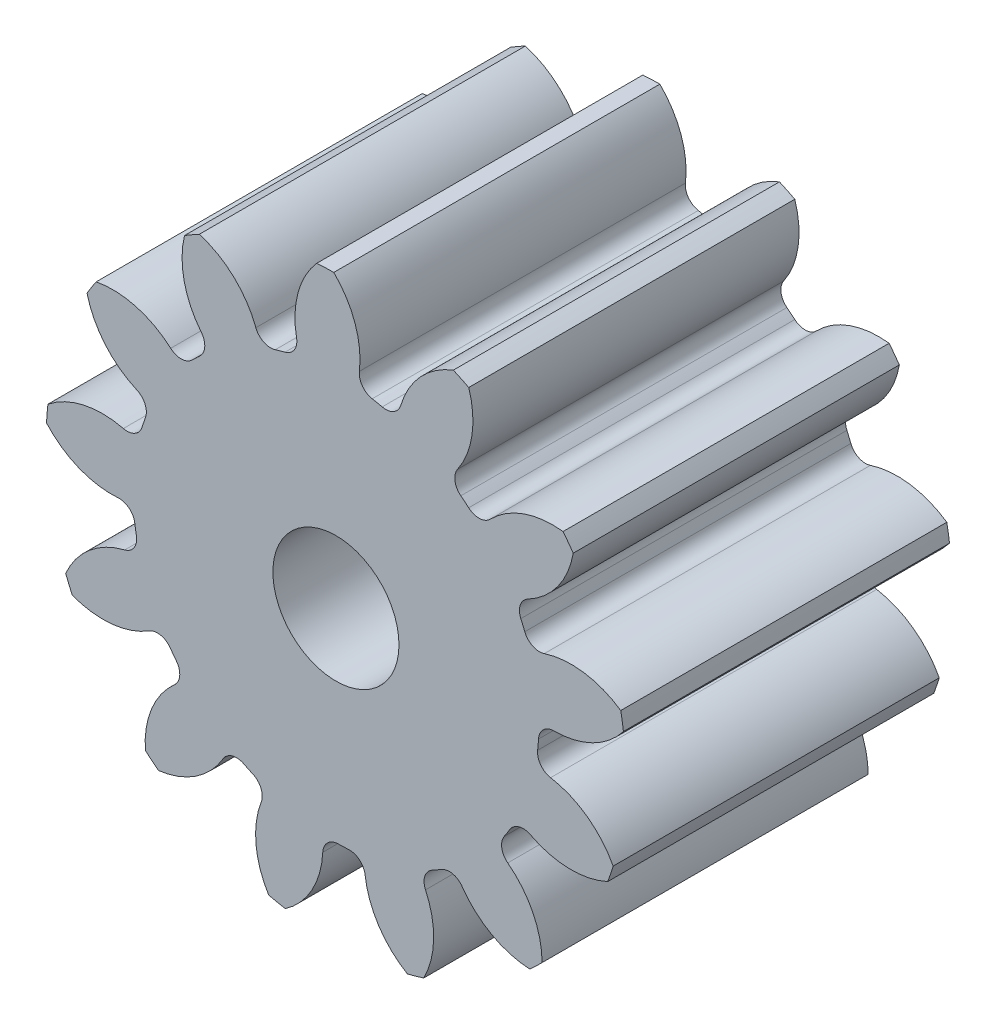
ISO-10303-21;
HEADER;
FILE_DESCRIPTION(('STEP AP214'),'2;1');
FILE_NAME('part.step','',(''),(''),'','','');
FILE_SCHEMA(('AUTOMOTIVE_DESIGN { 1 0 10303 214 1 1 1 1 }'));
ENDSEC;
DATA;
#1=APPLICATION_CONTEXT('core data for automotive mechanical design processes');
#2=APPLICATION_PROTOCOL_DEFINITION('international standard','automotive_design',2000,#1);
#3=PRODUCT_CONTEXT('',#1,'mechanical');
#4=PRODUCT('Part','Part','',(#3));
#5=PRODUCT_RELATED_PRODUCT_CATEGORY('part','',(#4));
#6=PRODUCT_DEFINITION_FORMATION('','',#4);
#7=PRODUCT_DEFINITION_CONTEXT('part definition',#1,'design');
#8=PRODUCT_DEFINITION('design','',#6,#7);
#9=PRODUCT_DEFINITION_SHAPE('','',#8);
#10=(LENGTH_UNIT() NAMED_UNIT(*) SI_UNIT(.MILLI.,.METRE.));
#11=(NAMED_UNIT(*) PLANE_ANGLE_UNIT() SI_UNIT($,.RADIAN.));
#12=(NAMED_UNIT(*) SI_UNIT($,.STERADIAN.) SOLID_ANGLE_UNIT());
#13=UNCERTAINTY_MEASURE_WITH_UNIT(LENGTH_MEASURE(1.E-05),#10,'distance_accuracy_value','');
#14=(GEOMETRIC_REPRESENTATION_CONTEXT(3) GLOBAL_UNCERTAINTY_ASSIGNED_CONTEXT((#13)) GLOBAL_UNIT_ASSIGNED_CONTEXT((#10,
#11,#12)) REPRESENTATION_CONTEXT('',''));
#15=CARTESIAN_POINT('',(0.,0.,0.));
#16=DIRECTION('',(0.,0.,1.));
#17=DIRECTION('',(1.,0.,0.));
#18=AXIS2_PLACEMENT_3D('',#15,#16,#17);
#19=CARTESIAN_POINT('',(0.,0.,95.25));
#20=DIRECTION('',(0.,0.,-1.));
#21=DIRECTION('',(-1.,0.,0.));
#22=AXIS2_PLACEMENT_3D('',#19,#20,#21);
#23=CYLINDRICAL_SURFACE('',#22,84.6666666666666);
#24=DIRECTION('',(0.,0.,-1.));
#25=VECTOR('',#24,1.);
#26=CARTESIAN_POINT('',(83.1895525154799,15.7461994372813,47.625));
#27=LINE('',#26,#25);
#28=CARTESIAN_POINT('',(83.1895525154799,15.7461994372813,95.25));
#29=VERTEX_POINT('',#28);
#30=CARTESIAN_POINT('',(83.1895525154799,15.7461994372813,0.));
#31=VERTEX_POINT('',#30);
#32=EDGE_CURVE('E564',#29,#31,#27,.T.);
#33=ORIENTED_EDGE('',*,*,#32,.F.);
#34=CARTESIAN_POINT('',(0.,0.,95.25));
#35=DIRECTION('',(0.,0.,1.));
#36=DIRECTION('',(1.,0.,0.));
#37=AXIS2_PLACEMENT_3D('',#34,#35,#36);
#38=CIRCLE('',#37,84.6666666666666);
#39=CARTESIAN_POINT('',(83.9712556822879,10.8292503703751,95.25));
#40=VERTEX_POINT('',#39);
#41=EDGE_CURVE('E1019',#40,#29,#38,.T.);
#42=ORIENTED_EDGE('',*,*,#41,.F.);
#43=DIRECTION('',(0.,0.,-1.));
#44=VECTOR('',#43,1.);
#45=CARTESIAN_POINT('',(83.9712556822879,10.8292503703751,47.625));
#46=LINE('',#45,#44);
#47=CARTESIAN_POINT('',(83.9712556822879,10.8292503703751,0.));
#48=VERTEX_POINT('',#47);
#49=EDGE_CURVE('E1013',#48,#40,#46,.F.);
#50=ORIENTED_EDGE('',*,*,#49,.F.);
#51=CARTESIAN_POINT('',(0.,0.,0.));
#52=DIRECTION('',(0.,0.,1.));
#53=DIRECTION('',(1.,0.,0.));
#54=AXIS2_PLACEMENT_3D('',#51,#52,#53);
#55=CIRCLE('',#54,84.6666666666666);
#56=EDGE_CURVE('E1024',#48,#31,#55,.T.);
#57=ORIENTED_EDGE('',*,*,#56,.T.);
#58=EDGE_LOOP('',(#33,#42,#50,#57));
#59=FACE_BOUND('',#58,.T.);
#60=ADVANCED_FACE('F33',(#59),#23,.T.);
#61=DIRECTION('',(0.,0.,-1.));
#62=VECTOR('',#61,1.);
#63=CARTESIAN_POINT('',(69.3202507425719,48.6122132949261,47.625));
#64=LINE('',#63,#62);
#65=CARTESIAN_POINT('',(69.3202507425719,48.6122132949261,0.));
#66=VERTEX_POINT('',#65);
#67=CARTESIAN_POINT('',(69.3202507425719,48.6122132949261,95.25));
#68=VERTEX_POINT('',#67);
#69=EDGE_CURVE('E535',#66,#68,#64,.F.);
#70=ORIENTED_EDGE('',*,*,#69,.F.);
#71=CARTESIAN_POINT('',(66.3430667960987,52.6026798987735,0.));
#72=VERTEX_POINT('',#71);
#73=EDGE_CURVE('E1027',#66,#72,#55,.T.);
#74=ORIENTED_EDGE('',*,*,#73,.T.);
#75=DIRECTION('',(0.,0.,-1.));
#76=VECTOR('',#75,1.);
#77=CARTESIAN_POINT('',(66.3430667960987,52.6026798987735,47.625));
#78=LINE('',#77,#76);
#79=CARTESIAN_POINT('',(66.3430667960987,52.6026798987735,95.25));
#80=VERTEX_POINT('',#79);
#81=EDGE_CURVE('E597',#80,#72,#78,.T.);
#82=ORIENTED_EDGE('',*,*,#81,.F.);
#83=EDGE_CURVE('E1022',#68,#80,#38,.T.);
#84=ORIENTED_EDGE('',*,*,#83,.F.);
#85=EDGE_LOOP('',(#70,#74,#82,#84));
#86=FACE_BOUND('',#85,.T.);
#87=ADVANCED_FACE('F1176',(#86),#23,.T.);
#88=CARTESIAN_POINT('',(0.,0.,95.25));
#89=DIRECTION('',(0.,0.,1.));
#90=DIRECTION('',(1.,0.,0.));
#91=AXIS2_PLACEMENT_3D('',#88,#89,#90);
#92=PLANE('',#91);
#93=CARTESIAN_POINT('',(0.,0.,95.2500000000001));
#94=DIRECTION('',(0.,0.,1.));
#95=DIRECTION('',(1.,0.,0.));
#96=AXIS2_PLACEMENT_3D('',#93,#94,#95);
#97=CIRCLE('',#96,18.415);
#98=CARTESIAN_POINT('',(18.415,0.,95.2499999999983));
#99=VERTEX_POINT('',#98);
#100=EDGE_CURVE('E552',#99,#99,#97,.T.);
#101=ORIENTED_EDGE('',*,*,#100,.F.);
#102=EDGE_LOOP('',(#101));
#103=FACE_BOUND('',#102,.T.);
#104=ORIENTED_EDGE('',*,*,#41,.T.);
#105=CARTESIAN_POINT('',(68.7462517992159,-5.32990477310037,95.25));
#106=DIRECTION('',(0.,0.,-1.));
#107=DIRECTION('',(0.885456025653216,0.464723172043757,0.));
#108=AXIS2_PLACEMENT_3D('',#105,#106,#107);
#109=CIRCLE('',#108,25.55016838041);
#110=CARTESIAN_POINT('',(60.8601949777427,18.972794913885,95.25));
#111=VERTEX_POINT('',#110);
#112=EDGE_CURVE('E544',#111,#29,#109,.T.);
#113=ORIENTED_EDGE('',*,*,#112,.F.);
#114=CARTESIAN_POINT('',(59.4420790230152,23.3430457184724,95.25));
#115=DIRECTION('',(0.,0.,1.));
#116=DIRECTION('',(-0.885456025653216,-0.464723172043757,0.));
#117=AXIS2_PLACEMENT_3D('',#114,#115,#116);
#118=CIRCLE('',#117,4.59457777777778);
#119=CARTESIAN_POINT('',(55.1654436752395,21.6636008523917,95.25));
#120=VERTEX_POINT('',#119);
#121=EDGE_CURVE('E542',#120,#111,#118,.T.);
#122=ORIENTED_EDGE('',*,*,#121,.F.);
#123=CARTESIAN_POINT('',(0.,0.,95.25));
#124=DIRECTION('',(0.,0.,-1.));
#125=DIRECTION('',(0.885456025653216,0.464723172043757,0.));
#126=AXIS2_PLACEMENT_3D('',#123,#124,#125);
#127=CIRCLE('',#126,59.2666666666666);
#128=CARTESIAN_POINT('',(54.0077547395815,24.4069704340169,95.25));
#129=VERTEX_POINT('',#128);
#130=EDGE_CURVE('E527',#129,#120,#127,.T.);
#131=ORIENTED_EDGE('',*,*,#130,.F.);
#132=CARTESIAN_POINT('',(58.1946416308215,26.2990917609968,95.25));
#133=DIRECTION('',(0.,0.,1.));
#134=DIRECTION('',(-0.885456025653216,-0.464723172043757,0.));
#135=AXIS2_PLACEMENT_3D('',#132,#133,#134);
#136=CIRCLE('',#135,4.59457777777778);
#137=CARTESIAN_POINT('',(56.0531297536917,30.3640729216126,95.25));
#138=VERTEX_POINT('',#137);
#139=EDGE_CURVE('E519',#138,#129,#136,.T.);
#140=ORIENTED_EDGE('',*,*,#139,.F.);
#141=CARTESIAN_POINT('',(44.1443120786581,52.9691866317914,95.25));
#142=DIRECTION('',(0.,0.,-1.));
#143=DIRECTION('',(-0.885456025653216,-0.464723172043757,0.));
#144=AXIS2_PLACEMENT_3D('',#141,#142,#143);
#145=CIRCLE('',#144,25.55016838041);
#146=EDGE_CURVE('E549',#68,#138,#145,.T.);
#147=ORIENTED_EDGE('',*,*,#146,.F.);
#148=ORIENTED_EDGE('',*,*,#83,.T.);
#149=CARTESIAN_POINT('',(63.3487131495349,27.2285799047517,95.25));
#150=DIRECTION('',(0.,0.,-1.));
#151=DIRECTION('',(0.568064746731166,0.822983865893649,0.));
#152=AXIS2_PLACEMENT_3D('',#149,#150,#151);
#153=CIRCLE('',#152,25.55016838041);
#154=CARTESIAN_POINT('',(45.0719289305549,45.0827184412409,95.25));
#155=VERTEX_POINT('',#154);
#156=EDGE_CURVE('E573',#155,#80,#153,.T.);
#157=ORIENTED_EDGE('',*,*,#156,.F.);
#158=CARTESIAN_POINT('',(41.7852927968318,48.2933520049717,95.25));
#159=DIRECTION('',(0.,0.,1.));
#160=DIRECTION('',(-0.568064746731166,-0.822983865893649,0.));
#161=AXIS2_PLACEMENT_3D('',#158,#159,#160);
#162=CIRCLE('',#161,4.59457777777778);
#163=CARTESIAN_POINT('',(38.7789972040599,44.8188258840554,95.25));
#164=VERTEX_POINT('',#163);
#165=EDGE_CURVE('E571',#164,#155,#162,.T.);
#166=ORIENTED_EDGE('',*,*,#165,.F.);
#167=CARTESIAN_POINT('',(0.,0.,95.25));
#168=DIRECTION('',(0.,0.,-1.));
#169=DIRECTION('',(0.568064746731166,0.822983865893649,0.));
#170=AXIS2_PLACEMENT_3D('',#167,#168,#169);
#171=CIRCLE('',#170,59.2666666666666);
#172=CARTESIAN_POINT('',(36.4790071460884,46.7099541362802,95.25));
#173=VERTEX_POINT('',#172);
#174=EDGE_CURVE('E568',#173,#164,#171,.T.);
#175=ORIENTED_EDGE('',*,*,#174,.F.);
#176=CARTESIAN_POINT('',(39.3069987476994,50.3310877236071,95.25));
#177=DIRECTION('',(0.,0.,1.));
#178=DIRECTION('',(-0.568064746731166,-0.822983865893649,0.));
#179=AXIS2_PLACEMENT_3D('',#176,#177,#178);
#180=CIRCLE('',#179,4.59457777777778);
#181=CARTESIAN_POINT('',(35.5216932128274,52.9352395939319,95.25));
#182=VERTEX_POINT('',#181);
#183=EDGE_CURVE('E566',#182,#173,#180,.T.);
#184=ORIENTED_EDGE('',*,*,#183,.F.);
#185=CARTESIAN_POINT('',(14.4718386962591,67.4167702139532,95.25));
#186=DIRECTION('',(0.,0.,-1.));
#187=DIRECTION('',(-0.568064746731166,-0.822983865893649,0.));
#188=AXIS2_PLACEMENT_3D('',#185,#186,#187);
#189=CIRCLE('',#188,25.55016838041);
#190=CARTESIAN_POINT('',(38.7888117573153,75.2587039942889,95.25));
#191=VERTEX_POINT('',#190);
#192=EDGE_CURVE('E576',#191,#182,#189,.T.);
#193=ORIENTED_EDGE('',*,*,#192,.F.);
#194=CARTESIAN_POINT('',(34.2981839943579,77.4085203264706,95.25));
#195=VERTEX_POINT('',#194);
#196=EDGE_CURVE('E1061',#191,#195,#38,.T.);
#197=ORIENTED_EDGE('',*,*,#196,.T.);
#198=CARTESIAN_POINT('',(43.4387477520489,53.549325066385,95.25));
#199=DIRECTION('',(0.,0.,-1.));
#200=DIRECTION('',(0.120536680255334,0.992708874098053,0.));
#201=AXIS2_PLACEMENT_3D('',#198,#199,#200);
#202=CIRCLE('',#201,25.55016838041);
#203=CARTESIAN_POINT('',(18.9582271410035,60.8647344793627,95.25));
#204=VERTEX_POINT('',#203);
#205=EDGE_CURVE('E608',#204,#195,#202,.T.);
#206=ORIENTED_EDGE('',*,*,#205,.F.);
#207=CARTESIAN_POINT('',(14.5559995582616,62.1802333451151,95.25));
#208=DIRECTION('',(0.,0.,1.));
#209=DIRECTION('',(-0.120536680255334,-0.992708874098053,0.));
#210=AXIS2_PLACEMENT_3D('',#207,#208,#209);
#211=CIRCLE('',#210,4.59457777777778);
#212=CARTESIAN_POINT('',(13.5087498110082,57.7065980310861,95.25));
#213=VERTEX_POINT('',#212);
#214=EDGE_CURVE('E606',#213,#204,#211,.T.);
#215=ORIENTED_EDGE('',*,*,#214,.F.);
#216=CARTESIAN_POINT('',(0.,0.,95.25));
#217=DIRECTION('',(0.,0.,-1.));
#218=DIRECTION('',(0.120536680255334,0.992708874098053,0.));
#219=AXIS2_PLACEMENT_3D('',#216,#217,#218);
#220=CIRCLE('',#219,59.2666666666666);
#221=CARTESIAN_POINT('',(10.5933586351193,58.3122502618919,95.25));
#222=VERTEX_POINT('',#221);
#223=EDGE_CURVE('E603',#222,#213,#220,.T.);
#224=ORIENTED_EDGE('',*,*,#223,.F.);
#225=CARTESIAN_POINT('',(11.4145961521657,62.8328380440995,95.25));
#226=DIRECTION('',(0.,0.,1.));
#227=DIRECTION('',(-0.120536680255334,-0.992708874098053,0.));
#228=AXIS2_PLACEMENT_3D('',#225,#226,#227);
#229=CIRCLE('',#228,4.59457777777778);
#230=CARTESIAN_POINT('',(6.85266483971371,63.3795808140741,95.25));
#231=VERTEX_POINT('',#230);
#232=EDGE_CURVE('E601',#231,#222,#229,.T.);
#233=ORIENTED_EDGE('',*,*,#232,.F.);
#234=CARTESIAN_POINT('',(-18.5159585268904,66.4199842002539,95.25));
#235=DIRECTION('',(0.,0.,-1.));
#236=DIRECTION('',(-0.120536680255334,-0.992708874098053,0.));
#237=AXIS2_PLACEMENT_3D('',#234,#235,#236);
#238=CIRCLE('',#237,25.55016838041);
#239=CARTESIAN_POINT('',(-0.628676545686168,84.6643325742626,95.25));
#240=VERTEX_POINT('',#239);
#241=EDGE_CURVE('E611',#240,#231,#238,.T.);
#242=ORIENTED_EDGE('',*,*,#241,.F.);
#243=CARTESIAN_POINT('',(-5.6039994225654,84.4810016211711,95.25));
#244=VERTEX_POINT('',#243);
#245=EDGE_CURVE('E1158',#240,#244,#38,.T.);
#246=ORIENTED_EDGE('',*,*,#245,.T.);
#247=CARTESIAN_POINT('',(13.5774887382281,67.6025651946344,95.25));
#248=DIRECTION('',(0.,0.,-1.));
#249=DIRECTION('',(-0.354604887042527,0.935016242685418,0.));
#250=AXIS2_PLACEMENT_3D('',#247,#248,#249);
#251=CIRCLE('',#250,25.55016838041);
#252=CARTESIAN_POINT('',(-11.4985760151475,62.7033733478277,95.25));
#253=VERTEX_POINT('',#252);
#254=EDGE_CURVE('E646',#253,#244,#251,.T.);
#255=ORIENTED_EDGE('',*,*,#254,.F.);
#256=CARTESIAN_POINT('',(-16.0078977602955,61.8223725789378,95.25));
#257=DIRECTION('',(0.,0.,1.));
#258=DIRECTION('',(0.354604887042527,-0.935016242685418,0.));
#259=AXIS2_PLACEMENT_3D('',#256,#257,#258);
#260=CIRCLE('',#259,4.59457777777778);
#261=CARTESIAN_POINT('',(-14.8561893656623,57.3744840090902,95.25));
#262=VERTEX_POINT('',#261);
#263=EDGE_CURVE('E644',#262,#253,#260,.T.);
#264=ORIENTED_EDGE('',*,*,#263,.F.);
#265=CARTESIAN_POINT('',(0.,0.,95.25));
#266=DIRECTION('',(0.,0.,-1.));
#267=DIRECTION('',(-0.354604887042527,0.935016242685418,0.));
#268=AXIS2_PLACEMENT_3D('',#265,#266,#267);
#269=CIRCLE('',#268,59.2666666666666);
#270=CARTESIAN_POINT('',(-17.7191006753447,56.5559125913,95.25));
#271=VERTEX_POINT('',#270);
#272=EDGE_CURVE('E641',#271,#262,#269,.T.);
#273=ORIENTED_EDGE('',*,*,#272,.F.);
#274=CARTESIAN_POINT('',(-19.0927528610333,60.9403423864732,95.25));
#275=DIRECTION('',(0.,0.,1.));
#276=DIRECTION('',(0.354604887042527,-0.935016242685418,0.));
#277=AXIS2_PLACEMENT_3D('',#274,#275,#276);
#278=CIRCLE('',#277,4.59457777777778);
#279=CARTESIAN_POINT('',(-23.3862264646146,59.304423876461,95.25));
#280=VERTEX_POINT('',#279);
#281=EDGE_CURVE('E639',#280,#271,#278,.T.);
#282=ORIENTED_EDGE('',*,*,#281,.F.);
#283=CARTESIAN_POINT('',(-47.2619727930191,50.2071802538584,95.25));
#284=DIRECTION('',(0.,0.,-1.));
#285=DIRECTION('',(0.354604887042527,-0.935016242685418,0.));
#286=AXIS2_PLACEMENT_3D('',#283,#284,#285);
#287=CIRCLE('',#286,25.55016838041);
#288=CARTESIAN_POINT('',(-39.9021426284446,74.6743828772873,95.25));
#289=VERTEX_POINT('',#288);
#290=EDGE_CURVE('E649',#289,#280,#287,.T.);
#291=ORIENTED_EDGE('',*,*,#290,.F.);
#292=CARTESIAN_POINT('',(-44.2223741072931,72.1999035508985,95.25));
#293=VERTEX_POINT('',#292);
#294=EDGE_CURVE('E1154',#289,#293,#38,.T.);
#295=ORIENTED_EDGE('',*,*,#294,.T.);
#296=CARTESIAN_POINT('',(-19.3942093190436,66.1688723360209,95.25));
#297=DIRECTION('',(0.,0.,-1.));
#298=DIRECTION('',(-0.748510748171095,0.663122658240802,0.));
#299=AXIS2_PLACEMENT_3D('',#296,#297,#298);
#300=CIRCLE('',#299,25.55016838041);
#301=CARTESIAN_POINT('',(-39.3211939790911,50.1774250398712,95.25));
#302=VERTEX_POINT('',#301);
#303=EDGE_CURVE('E684',#302,#293,#300,.T.);
#304=ORIENTED_EDGE('',*,*,#303,.F.);
#305=CARTESIAN_POINT('',(-42.9045786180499,47.3017512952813,95.25));
#306=DIRECTION('',(0.,0.,1.));
#307=DIRECTION('',(0.748510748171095,-0.663122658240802,0.));
#308=AXIS2_PLACEMENT_3D('',#305,#306,#307);
#309=CIRCLE('',#308,4.59457777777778);
#310=CARTESIAN_POINT('',(-39.8177545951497,43.8985671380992,95.25));
#311=VERTEX_POINT('',#310);
#312=EDGE_CURVE('E682',#311,#302,#309,.T.);
#313=ORIENTED_EDGE('',*,*,#312,.F.);
#314=CARTESIAN_POINT('',(0.,0.,95.25));
#315=DIRECTION('',(0.,0.,-1.));
#316=DIRECTION('',(-0.748510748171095,0.663122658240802,0.));
#317=AXIS2_PLACEMENT_3D('',#314,#315,#316);
#318=CIRCLE('',#317,59.2666666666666);
#319=CARTESIAN_POINT('',(-41.9723275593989,41.8432969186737,95.25));
#320=VERTEX_POINT('',#319);
#321=EDGE_CURVE('E679',#320,#311,#318,.T.);
#322=ORIENTED_EDGE('',*,*,#321,.F.);
#323=CARTESIAN_POINT('',(-45.2261822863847,45.0871486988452,95.25));
#324=DIRECTION('',(0.,0.,1.));
#325=DIRECTION('',(0.748510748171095,-0.663122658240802,0.));
#326=AXIS2_PLACEMENT_3D('',#323,#324,#325);
#327=CIRCLE('',#326,4.59457777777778);
#328=CARTESIAN_POINT('',(-48.2676151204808,41.6433381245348,95.25));
#329=VERTEX_POINT('',#328);
#330=EDGE_CURVE('E677',#329,#320,#327,.T.);
#331=ORIENTED_EDGE('',*,*,#330,.F.);
#332=CARTESIAN_POINT('',(-65.1808386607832,22.4925163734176,95.25));
#333=DIRECTION('',(0.,0.,-1.));
#334=DIRECTION('',(0.748510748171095,-0.663122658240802,0.));
#335=AXIS2_PLACEMENT_3D('',#332,#333,#334);
#336=CIRCLE('',#335,25.55016838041);
#337=CARTESIAN_POINT('',(-70.034508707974,47.5774319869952,95.25));
#338=VERTEX_POINT('',#337);
#339=EDGE_CURVE('E687',#338,#329,#336,.T.);
#340=ORIENTED_EDGE('',*,*,#339,.F.);
#341=CARTESIAN_POINT('',(-72.7099358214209,43.3786776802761,95.25));
#342=VERTEX_POINT('',#341);
#343=EDGE_CURVE('E1150',#338,#342,#38,.T.);
#344=ORIENTED_EDGE('',*,*,#343,.T.);
#345=CARTESIAN_POINT('',(-47.9229277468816,49.5766882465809,95.25));
#346=DIRECTION('',(0.,0.,-1.));
#347=DIRECTION('',(-0.97094181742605,0.239315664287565,0.));
#348=AXIS2_PLACEMENT_3D('',#345,#346,#347);
#349=CIRCLE('',#348,25.55016838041);
#350=CARTESIAN_POINT('',(-58.1358002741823,26.1564333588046,95.25));
#351=VERTEX_POINT('',#350);
#352=EDGE_CURVE('E722',#351,#342,#349,.T.);
#353=ORIENTED_EDGE('',*,*,#352,.F.);
#354=CARTESIAN_POINT('',(-59.9723375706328,21.9448688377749,95.25));
#355=DIRECTION('',(0.,0.,1.));
#356=DIRECTION('',(0.97094181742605,-0.239315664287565,0.));
#357=AXIS2_PLACEMENT_3D('',#354,#355,#356);
#358=CIRCLE('',#357,4.59457777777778);
#359=CARTESIAN_POINT('',(-55.6575521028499,20.3660175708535,95.25));
#360=VERTEX_POINT('',#359);
#361=EDGE_CURVE('E720',#360,#351,#358,.T.);
#362=ORIENTED_EDGE('',*,*,#361,.F.);
#363=CARTESIAN_POINT('',(0.,0.,95.25));
#364=DIRECTION('',(0.,0.,-1.));
#365=DIRECTION('',(-0.97094181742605,0.239315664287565,0.));
#366=AXIS2_PLACEMENT_3D('',#363,#364,#365);
#367=CIRCLE('',#366,59.2666666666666);
#368=CARTESIAN_POINT('',(-56.6102000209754,17.544886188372,95.25));
#369=VERTEX_POINT('',#368);
#370=EDGE_CURVE('E717',#369,#360,#367,.T.);
#371=ORIENTED_EDGE('',*,*,#370,.F.);
#372=CARTESIAN_POINT('',(-60.9988383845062,18.9050326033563,95.25));
#373=DIRECTION('',(0.,0.,1.));
#374=DIRECTION('',(0.97094181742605,-0.239315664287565,0.));
#375=AXIS2_PLACEMENT_3D('',#372,#373,#374);
#376=CIRCLE('',#375,4.59457777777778);
#377=CARTESIAN_POINT('',(-62.0914748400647,14.4422654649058,95.25));
#378=VERTEX_POINT('',#377);
#379=EDGE_CURVE('E715',#378,#369,#376,.T.);
#380=ORIENTED_EDGE('',*,*,#379,.F.);
#381=CARTESIAN_POINT('',(-68.1675599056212,-10.3749119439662,95.25));
#382=DIRECTION('',(0.,0.,-1.));
#383=DIRECTION('',(0.97094181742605,-0.239315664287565,0.));
#384=AXIS2_PLACEMENT_3D('',#381,#382,#383);
#385=CIRCLE('',#384,25.55016838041);
#386=CARTESIAN_POINT('',(-84.1228128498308,9.58106479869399,95.25));
#387=VERTEX_POINT('',#386);
#388=EDGE_CURVE('E725',#387,#378,#385,.T.);
#389=ORIENTED_EDGE('',*,*,#388,.F.);
#390=CARTESIAN_POINT('',(-84.5405274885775,4.61991952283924,95.25));
#391=VERTEX_POINT('',#390);
#392=EDGE_CURVE('E1146',#387,#391,#38,.T.);
#393=ORIENTED_EDGE('',*,*,#392,.T.);
#394=CARTESIAN_POINT('',(-65.4730809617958,21.6270823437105,95.25));
#395=DIRECTION('',(0.,0.,-1.));
#396=DIRECTION('',(-0.970941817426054,-0.239315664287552,0.));
#397=AXIS2_PLACEMENT_3D('',#394,#395,#396);
#398=CIRCLE('',#397,25.55016838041);
#399=CARTESIAN_POINT('',(-63.6321953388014,-3.8566819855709,95.25));
#400=VERTEX_POINT('',#399);
#401=EDGE_CURVE('E760',#400,#391,#398,.T.);
#402=ORIENTED_EDGE('',*,*,#401,.F.);
#403=CARTESIAN_POINT('',(-63.3011567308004,-8.43931860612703,95.25));
#404=DIRECTION('',(0.,0.,1.));
#405=DIRECTION('',(0.970941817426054,0.239315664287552,0.));
#406=AXIS2_PLACEMENT_3D('',#403,#404,#405);
#407=CIRCLE('',#406,4.59457777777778);
#408=CARTESIAN_POINT('',(-58.7468751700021,-7.83214118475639,95.25));
#409=VERTEX_POINT('',#408);
#410=EDGE_CURVE('E758',#409,#400,#407,.T.);
#411=ORIENTED_EDGE('',*,*,#410,.F.);
#412=CARTESIAN_POINT('',(0.,0.,95.25));
#413=DIRECTION('',(0.,0.,-1.));
#414=DIRECTION('',(-0.970941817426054,-0.239315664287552,0.));
#415=AXIS2_PLACEMENT_3D('',#412,#413,#414);
#416=CIRCLE('',#415,59.2666666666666);
#417=CARTESIAN_POINT('',(-58.2793578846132,-10.7728465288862,95.25));
#418=VERTEX_POINT('',#417);
#419=EDGE_CURVE('E755',#418,#409,#416,.T.);
#420=ORIENTED_EDGE('',*,*,#419,.F.);
#421=CARTESIAN_POINT('',(-62.7973957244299,-11.6079986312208,95.25));
#422=DIRECTION('',(0.,0.,1.));
#423=DIRECTION('',(0.970941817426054,0.239315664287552,0.));
#424=AXIS2_PLACEMENT_3D('',#421,#422,#423);
#425=CIRCLE('',#424,4.59457777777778);
#426=CARTESIAN_POINT('',(-61.6909259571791,-16.0673561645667,95.25));
#427=VERTEX_POINT('',#426);
#428=EDGE_CURVE('E753',#427,#418,#425,.T.);
#429=ORIENTED_EDGE('',*,*,#428,.F.);
#430=CARTESIAN_POINT('',(-55.5379146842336,-40.8655729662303,95.25));
#431=DIRECTION('',(0.,0.,-1.));
#432=DIRECTION('',(0.970941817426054,0.239315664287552,0.));
#433=AXIS2_PLACEMENT_3D('',#430,#431,#432);
#434=CIRCLE('',#433,25.55016838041);
#435=CARTESIAN_POINT('',(-78.9395943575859,-30.6102088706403,95.25));
#436=VERTEX_POINT('',#435);
#437=EDGE_CURVE('E763',#436,#427,#434,.T.);
#438=ORIENTED_EDGE('',*,*,#437,.F.);
#439=CARTESIAN_POINT('',(-77.0039031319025,-35.1972065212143,95.25));
#440=VERTEX_POINT('',#439);
#441=EDGE_CURVE('E1142',#436,#440,#38,.T.);
#442=ORIENTED_EDGE('',*,*,#441,.T.);
#443=CARTESIAN_POINT('',(-68.0241403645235,-11.2770274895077,95.25));
#444=DIRECTION('',(0.,0.,-1.));
#445=DIRECTION('',(-0.748510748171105,-0.663122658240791,0.));
#446=AXIS2_PLACEMENT_3D('',#443,#444,#445);
#447=CIRCLE('',#446,25.55016838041);
#448=CARTESIAN_POINT('',(-54.5512213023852,-32.9862779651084,95.25));
#449=VERTEX_POINT('',#448);
#450=EDGE_CURVE('E798',#449,#440,#447,.T.);
#451=ORIENTED_EDGE('',*,*,#450,.F.);
#452=CARTESIAN_POINT('',(-52.128443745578,-36.8901598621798,95.25));
#453=DIRECTION('',(0.,0.,1.));
#454=DIRECTION('',(0.748510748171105,0.663122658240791,0.));
#455=AXIS2_PLACEMENT_3D('',#452,#453,#454);
#456=CIRCLE('',#455,4.59457777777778);
#457=CARTESIAN_POINT('',(-48.3779971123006,-34.2360507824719,95.25));
#458=VERTEX_POINT('',#457);
#459=EDGE_CURVE('E796',#458,#449,#456,.T.);
#460=ORIENTED_EDGE('',*,*,#459,.F.);
#461=CARTESIAN_POINT('',(0.,0.,95.25));
#462=DIRECTION('',(0.,0.,-1.));
#463=DIRECTION('',(-0.748510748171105,-0.663122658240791,0.));
#464=AXIS2_PLACEMENT_3D('',#461,#462,#463);
#465=CIRCLE('',#464,59.2666666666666);
#466=CARTESIAN_POINT('',(-46.597417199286,-36.622649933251,95.25));
#467=VERTEX_POINT('',#466);
#468=EDGE_CURVE('E793',#467,#458,#465,.T.);
#469=ORIENTED_EDGE('',*,*,#468,.F.);
#470=CARTESIAN_POINT('',(-50.2098264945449,-39.4617772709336,95.25));
#471=DIRECTION('',(0.,0.,1.));
#472=DIRECTION('',(0.748510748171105,0.663122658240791,0.));
#473=AXIS2_PLACEMENT_3D('',#470,#471,#472);
#474=CIRCLE('',#473,4.59457777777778);
#475=CARTESIAN_POINT('',(-47.1577293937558,-42.8961401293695,95.25));
#476=VERTEX_POINT('',#475);
#477=EDGE_CURVE('E791',#476,#467,#474,.T.);
#478=ORIENTED_EDGE('',*,*,#477,.F.);
#479=CARTESIAN_POINT('',(-30.1852025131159,-61.9944237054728,95.25));
#480=DIRECTION('',(0.,0.,-1.));
#481=DIRECTION('',(0.748510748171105,0.663122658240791,0.));
#482=AXIS2_PLACEMENT_3D('',#479,#480,#481);
#483=CIRCLE('',#482,25.55016838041);
#484=CARTESIAN_POINT('',(-55.6722661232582,-63.7890525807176,95.25));
#485=VERTEX_POINT('',#484);
#486=EDGE_CURVE('E801',#485,#476,#483,.T.);
#487=ORIENTED_EDGE('',*,*,#486,.F.);
#488=CARTESIAN_POINT('',(-51.8266125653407,-66.9510767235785,95.25));
#489=VERTEX_POINT('',#488);
#490=EDGE_CURVE('E1138',#485,#489,#38,.T.);
#491=ORIENTED_EDGE('',*,*,#490,.T.);
#492=CARTESIAN_POINT('',(-54.9916889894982,-41.5977062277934,95.25));
#493=DIRECTION('',(0.,0.,-1.));
#494=DIRECTION('',(-0.35460488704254,-0.935016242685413,0.));
#495=AXIS2_PLACEMENT_3D('',#492,#493,#494);
#496=CIRCLE('',#495,25.55016838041);
#497=CARTESIAN_POINT('',(-32.9732198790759,-54.559115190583,95.25));
#498=VERTEX_POINT('',#497);
#499=EDGE_CURVE('E836',#498,#489,#496,.T.);
#500=ORIENTED_EDGE('',*,*,#499,.F.);
#501=CARTESIAN_POINT('',(-29.0137325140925,-56.8899100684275,95.25));
#502=DIRECTION('',(0.,0.,1.));
#503=DIRECTION('',(0.35460488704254,0.935016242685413,0.));
#504=AXIS2_PLACEMENT_3D('',#501,#502,#503);
#505=CIRCLE('',#504,4.59457777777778);
#506=CARTESIAN_POINT('',(-26.9263029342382,-52.7968937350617,95.25));
#507=VERTEX_POINT('',#506);
#508=EDGE_CURVE('E834',#507,#498,#505,.T.);
#509=ORIENTED_EDGE('',*,*,#508,.F.);
#510=CARTESIAN_POINT('',(0.,0.,95.25));
#511=DIRECTION('',(0.,0.,-1.));
#512=DIRECTION('',(-0.35460488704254,-0.935016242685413,0.));
#513=AXIS2_PLACEMENT_3D('',#510,#511,#512);
#514=CIRCLE('',#513,59.2666666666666);
#515=CARTESIAN_POINT('',(-24.2405697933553,-54.0826455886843,95.25));
#516=VERTEX_POINT('',#515);
#517=EDGE_CURVE('E831',#516,#507,#514,.T.);
#518=ORIENTED_EDGE('',*,*,#517,.F.);
#519=CARTESIAN_POINT('',(-26.119791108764,-58.2753383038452,95.25));
#520=DIRECTION('',(0.,0.,1.));
#521=DIRECTION('',(0.35460488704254,0.935016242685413,0.));
#522=AXIS2_PLACEMENT_3D('',#519,#520,#521);
#523=CIRCLE('',#522,4.59457777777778);
#524=CARTESIAN_POINT('',(-21.8212653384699,-59.8979353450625,95.25));
#525=VERTEX_POINT('',#524);
#526=EDGE_CURVE('E829',#525,#516,#523,.T.);
#527=ORIENTED_EDGE('',*,*,#526,.F.);
#528=CARTESIAN_POINT('',(2.08257578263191,-68.9210990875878,95.25));
#529=DIRECTION('',(0.,0.,-1.));
#530=DIRECTION('',(0.35460488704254,0.935016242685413,0.));
#531=AXIS2_PLACEMENT_3D('',#528,#529,#530);
#532=CIRCLE('',#531,25.55016838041);
#533=CARTESIAN_POINT('',(-19.6510926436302,-82.3545930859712,95.25));
#534=VERTEX_POINT('',#533);
#535=EDGE_CURVE('E839',#534,#525,#532,.T.);
#536=ORIENTED_EDGE('',*,*,#535,.F.);
#537=CARTESIAN_POINT('',(-14.7764696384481,-83.3672620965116,95.25));
#538=VERTEX_POINT('',#537);
#539=EDGE_CURVE('E1134',#534,#538,#38,.T.);
#540=ORIENTED_EDGE('',*,*,#539,.T.);
#541=CARTESIAN_POINT('',(-29.3613043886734,-62.3888517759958,95.25));
#542=DIRECTION('',(0.,0.,-1.));
#543=DIRECTION('',(0.12053668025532,-0.992708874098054,0.));
#544=AXIS2_PLACEMENT_3D('',#541,#542,#543);
#545=CIRCLE('',#544,25.55016838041);
#546=CARTESIAN_POINT('',(-3.84145115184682,-63.6331166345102,95.25));
#547=VERTEX_POINT('',#546);
#548=EDGE_CURVE('E874',#547,#538,#545,.T.);
#549=ORIENTED_EDGE('',*,*,#548,.F.);
#550=CARTESIAN_POINT('',(0.747675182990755,-63.8568674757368,95.25));
#551=DIRECTION('',(0.,0.,1.));
#552=DIRECTION('',(-0.12053668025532,0.992708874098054,0.));
#553=AXIS2_PLACEMENT_3D('',#550,#551,#552);
#554=CIRCLE('',#553,4.59457777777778);
#555=CARTESIAN_POINT('',(0.693882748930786,-59.2626046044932,95.25));
#556=VERTEX_POINT('',#555);
#557=EDGE_CURVE('E872',#556,#547,#554,.T.);
#558=ORIENTED_EDGE('',*,*,#557,.F.);
#559=CARTESIAN_POINT('',(0.,0.,95.25));
#560=DIRECTION('',(0.,0.,-1.));
#561=DIRECTION('',(0.12053668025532,-0.992708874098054,0.));
#562=AXIS2_PLACEMENT_3D('',#559,#560,#561);
#563=CIRCLE('',#562,59.2666666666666);
#564=CARTESIAN_POINT('',(3.66950002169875,-59.152958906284,95.25));
#565=VERTEX_POINT('',#564);
#566=EDGE_CURVE('E869',#565,#556,#563,.T.);
#567=ORIENTED_EDGE('',*,*,#566,.F.);
#568=CARTESIAN_POINT('',(3.95397364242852,-63.7387216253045,95.25));
#569=DIRECTION('',(0.,0.,1.));
#570=DIRECTION('',(-0.12053668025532,0.992708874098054,0.));
#571=AXIS2_PLACEMENT_3D('',#568,#569,#570);
#572=CIRCLE('',#571,4.59457777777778);
#573=CARTESIAN_POINT('',(8.51418763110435,-63.1778354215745,95.25));
#574=VERTEX_POINT('',#573);
#575=EDGE_CURVE('E867',#574,#565,#572,.T.);
#576=ORIENTED_EDGE('',*,*,#575,.F.);
#577=CARTESIAN_POINT('',(33.8732610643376,-60.0587812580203,95.25));
#578=DIRECTION('',(0.,0.,-1.));
#579=DIRECTION('',(-0.12053668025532,0.992708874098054,0.));
#580=AXIS2_PLACEMENT_3D('',#577,#578,#579);
#581=CIRCLE('',#580,25.55016838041);
#582=CARTESIAN_POINT('',(20.8719093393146,-82.0536887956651,95.25));
#583=VERTEX_POINT('',#582);
#584=EDGE_CURVE('E877',#583,#574,#581,.T.);
#585=ORIENTED_EDGE('',*,*,#584,.F.);
#586=CARTESIAN_POINT('',(25.6587844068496,-80.6850124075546,95.25));
#587=VERTEX_POINT('',#586);
#588=EDGE_CURVE('E1130',#583,#587,#38,.T.);
#589=ORIENTED_EDGE('',*,*,#588,.T.);
#590=CARTESIAN_POINT('',(2.99540120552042,-68.8874632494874,95.25));
#591=DIRECTION('',(0.,0.,-1.));
#592=DIRECTION('',(0.568064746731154,-0.822983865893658,0.));
#593=AXIS2_PLACEMENT_3D('',#590,#591,#592);
#594=CIRCLE('',#593,25.55016838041);
#595=CARTESIAN_POINT('',(26.1703477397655,-58.1295379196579,95.25));
#596=VERTEX_POINT('',#595);
#597=EDGE_CURVE('E912',#596,#587,#594,.T.);
#598=ORIENTED_EDGE('',*,*,#597,.F.);
#599=CARTESIAN_POINT('',(30.3377995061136,-56.1949861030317,95.25));
#600=DIRECTION('',(0.,0.,1.));
#601=DIRECTION('',(-0.568064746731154,0.822983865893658,0.));
#602=AXIS2_PLACEMENT_3D('',#599,#600,#601);
#603=CIRCLE('',#602,4.59457777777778);
#604=CARTESIAN_POINT('',(28.1551082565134,-52.1519669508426,95.25));
#605=VERTEX_POINT('',#604);
#606=EDGE_CURVE('E910',#605,#596,#603,.T.);
#607=ORIENTED_EDGE('',*,*,#606,.F.);
#608=CARTESIAN_POINT('',(0.,0.,95.25));
#609=DIRECTION('',(0.,0.,-1.));
#610=DIRECTION('',(0.568064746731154,-0.822983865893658,0.));
#611=AXIS2_PLACEMENT_3D('',#608,#609,#610);
#612=CIRCLE('',#611,59.2666666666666);
#613=CARTESIAN_POINT('',(30.7389316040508,-50.6720422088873,95.25));
#614=VERTEX_POINT('',#613);
#615=EDGE_CURVE('E907',#614,#605,#612,.T.);
#616=ORIENTED_EDGE('',*,*,#615,.F.);
#617=CARTESIAN_POINT('',(33.1219306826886,-54.6003319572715,95.25));
#618=DIRECTION('',(0.,0.,1.));
#619=DIRECTION('',(-0.568064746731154,0.822983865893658,0.));
#620=AXIS2_PLACEMENT_3D('',#617,#618,#619);
#621=CIRCLE('',#620,4.59457777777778);
#622=CARTESIAN_POINT('',(36.8991428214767,-51.9844547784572,95.25));
#623=VERTEX_POINT('',#622);
#624=EDGE_CURVE('E905',#623,#614,#621,.T.);
#625=ORIENTED_EDGE('',*,*,#624,.F.);
#626=CARTESIAN_POINT('',(57.9039904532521,-37.4377204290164,95.25));
#627=DIRECTION('',(0.,0.,-1.));
#628=DIRECTION('',(-0.568064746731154,0.822983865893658,0.));
#629=AXIS2_PLACEMENT_3D('',#626,#627,#628);
#630=CIRCLE('',#629,25.55016838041);
#631=CARTESIAN_POINT('',(56.6134084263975,-62.9552732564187,95.25));
#632=VERTEX_POINT('',#631);
#633=EDGE_CURVE('E915',#632,#623,#630,.T.);
#634=ORIENTED_EDGE('',*,*,#633,.F.);
#635=CARTESIAN_POINT('',(60.2159201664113,-59.5187987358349,95.25));
#636=VERTEX_POINT('',#635);
#637=EDGE_CURVE('E1129',#632,#636,#38,.T.);
#638=ORIENTED_EDGE('',*,*,#637,.T.);
#639=CARTESIAN_POINT('',(34.6658964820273,-59.6047870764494,95.25));
#640=DIRECTION('',(0.,0.,-1.));
#641=DIRECTION('',(0.885456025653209,-0.46472317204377,0.));
#642=AXIS2_PLACEMENT_3D('',#639,#640,#641);
#643=CIRCLE('',#642,25.55016838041);
#644=CARTESIAN_POINT('',(50.1868353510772,-39.3091826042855,95.25));
#645=VERTEX_POINT('',#644);
#646=EDGE_CURVE('E950',#645,#636,#643,.T.);
#647=ORIENTED_EDGE('',*,*,#646,.F.);
#648=CARTESIAN_POINT('',(52.9778995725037,-35.6595106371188,95.25));
#649=DIRECTION('',(0.,0.,1.));
#650=DIRECTION('',(-0.885456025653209,0.46472317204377,0.));
#651=AXIS2_PLACEMENT_3D('',#648,#649,#650);
#652=CIRCLE('',#651,4.59457777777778);
#653=CARTESIAN_POINT('',(49.1663377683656,-33.093942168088,95.25));
#654=VERTEX_POINT('',#653);
#655=EDGE_CURVE('E948',#654,#645,#652,.T.);
#656=ORIENTED_EDGE('',*,*,#655,.F.);
#657=CARTESIAN_POINT('',(0.,0.,95.25));
#658=DIRECTION('',(0.,0.,-1.));
#659=DIRECTION('',(0.885456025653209,-0.46472317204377,0.));
#660=AXIS2_PLACEMENT_3D('',#657,#658,#659);
#661=CIRCLE('',#660,59.2666666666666);
#662=CARTESIAN_POINT('',(50.7664444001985,-30.5827713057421,95.25));
#663=VERTEX_POINT('',#662);
#664=EDGE_CURVE('E945',#663,#654,#661,.T.);
#665=ORIENTED_EDGE('',*,*,#664,.F.);
#666=CARTESIAN_POINT('',(54.7020525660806,-32.9536642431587,95.25));
#667=DIRECTION('',(0.,0.,1.));
#668=DIRECTION('',(-0.885456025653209,0.46472317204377,0.));
#669=AXIS2_PLACEMENT_3D('',#666,#667,#668);
#670=CIRCLE('',#669,4.59457777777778);
#671=CARTESIAN_POINT('',(56.8309490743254,-28.882062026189,95.25));
#672=VERTEX_POINT('',#671);
#673=EDGE_CURVE('E943',#672,#663,#670,.T.);
#674=ORIENTED_EDGE('',*,*,#673,.F.);
#675=CARTESIAN_POINT('',(68.6696134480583,-6.24012902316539,95.25));
#676=DIRECTION('',(0.,0.,-1.));
#677=DIRECTION('',(-0.885456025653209,0.46472317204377,0.));
#678=AXIS2_PLACEMENT_3D('',#675,#676,#677);
#679=CIRCLE('',#678,25.55016838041);
#680=CARTESIAN_POINT('',(79.385457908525,-29.4345633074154,95.25));
#681=VERTEX_POINT('',#680);
#682=EDGE_CURVE('E953',#681,#672,#679,.T.);
#683=ORIENTED_EDGE('',*,*,#682,.F.);
#684=CARTESIAN_POINT('',(80.9783142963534,-24.7175455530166,95.25));
#685=VERTEX_POINT('',#684);
#686=EDGE_CURVE('E1023',#681,#685,#38,.T.);
#687=ORIENTED_EDGE('',*,*,#686,.T.);
#688=CARTESIAN_POINT('',(58.3948526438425,-36.66737249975,95.25));
#689=DIRECTION('',(0.,0.,-1.));
#690=DIRECTION('',(1.,0.,0.));
#691=AXIS2_PLACEMENT_3D('',#688,#689,#690);
#692=CIRCLE('',#691,25.55016838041);
#693=CARTESIAN_POINT('',(62.7061238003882,-11.483567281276,95.25));
#694=VERTEX_POINT('',#693);
#695=EDGE_CURVE('E988',#694,#685,#692,.T.);
#696=ORIENTED_EDGE('',*,*,#695,.F.);
#697=CARTESIAN_POINT('',(63.4814012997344,-6.95487102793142,95.25));
#698=DIRECTION('',(0.,0.,1.));
#699=DIRECTION('',(-1.,0.,0.));
#700=AXIS2_PLACEMENT_3D('',#697,#698,#699);
#701=CIRCLE('',#700,4.59457777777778);
#702=CARTESIAN_POINT('',(58.9141518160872,-6.45449405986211,95.25));
#703=VERTEX_POINT('',#702);
#704=EDGE_CURVE('E986',#703,#694,#701,.T.);
#705=ORIENTED_EDGE('',*,*,#704,.F.);
#706=CARTESIAN_POINT('',(0.,0.,95.25));
#707=DIRECTION('',(0.,0.,-1.));
#708=DIRECTION('',(1.,0.,0.));
#709=AXIS2_PLACEMENT_3D('',#706,#707,#708);
#710=CIRCLE('',#709,59.2666666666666);
#711=CARTESIAN_POINT('',(59.163976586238,-3.48735605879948,95.25));
#712=VERTEX_POINT('',#711);
#713=EDGE_CURVE('E983',#712,#703,#710,.T.);
#714=ORIENTED_EDGE('',*,*,#713,.F.);
#715=CARTESIAN_POINT('',(63.7505934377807,-3.75770918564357,95.25));
#716=DIRECTION('',(0.,0.,1.));
#717=DIRECTION('',(-1.,0.,0.));
#718=AXIS2_PLACEMENT_3D('',#715,#716,#717);
#719=CIRCLE('',#718,4.59457777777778);
#720=CARTESIAN_POINT('',(63.7434697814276,0.836863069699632,95.25));
#721=VERTEX_POINT('',#720);
#722=EDGE_CURVE('E981',#721,#712,#719,.T.);
#723=ORIENTED_EDGE('',*,*,#722,.F.);
#724=CARTESIAN_POINT('',(63.7038555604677,26.3870007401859,95.25));
#725=DIRECTION('',(0.,0.,-1.));
#726=DIRECTION('',(-1.,0.,0.));
#727=AXIS2_PLACEMENT_3D('',#724,#725,#726);
#728=CIRCLE('',#727,25.55016838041);
#729=EDGE_CURVE('E991',#40,#721,#728,.T.);
#730=ORIENTED_EDGE('',*,*,#729,.F.);
#731=EDGE_LOOP('',(#104,#113,#122,#131,#140,#147,#148,#157,#166,#175,#184,#193,#197,#206,#215,
#224,#233,#242,#246,#255,#264,#273,#282,#291,#295,#304,#313,#322,#331,#340,#344,#353,#362,#371,
#380,#389,#393,#402,#411,#420,#429,#438,#442,#451,#460,#469,#478,#487,#491,#500,#509,#518,#527,
#536,#540,#549,#558,#567,#576,#585,#589,#598,#607,#616,#625,#634,#638,#647,#656,#665,#674,#683,
#687,#696,#705,#714,#723,#730));
#732=FACE_BOUND('',#731,.T.);
#733=ADVANCED_FACE('F540',(#103,#732),#92,.T.);
#734=CARTESIAN_POINT('',(0.,0.,0.));
#735=DIRECTION('',(0.,0.,1.));
#736=DIRECTION('',(1.,0.,0.));
#737=AXIS2_PLACEMENT_3D('',#734,#735,#736);
#738=PLANE('',#737);
#739=CARTESIAN_POINT('',(0.,0.,0.));
#740=DIRECTION('',(0.,0.,1.));
#741=DIRECTION('',(1.,0.,0.));
#742=AXIS2_PLACEMENT_3D('',#739,#740,#741);
#743=CIRCLE('',#742,18.415);
#744=CARTESIAN_POINT('',(18.415,0.,-1.77635683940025E-12));
#745=VERTEX_POINT('',#744);
#746=EDGE_CURVE('E36',#745,#745,#743,.T.);
#747=ORIENTED_EDGE('',*,*,#746,.T.);
#748=EDGE_LOOP('',(#747));
#749=FACE_BOUND('',#748,.T.);
#750=CARTESIAN_POINT('',(68.7462517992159,-5.32990477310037,0.));
#751=DIRECTION('',(0.,0.,-1.));
#752=DIRECTION('',(0.885456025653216,0.464723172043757,0.));
#753=AXIS2_PLACEMENT_3D('',#750,#751,#752);
#754=CIRCLE('',#753,25.55016838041);
#755=CARTESIAN_POINT('',(60.8601949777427,18.972794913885,0.));
#756=VERTEX_POINT('',#755);
#757=EDGE_CURVE('E528',#756,#31,#754,.T.);
#758=ORIENTED_EDGE('',*,*,#757,.T.);
#759=ORIENTED_EDGE('',*,*,#56,.F.);
#760=CARTESIAN_POINT('',(63.7038555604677,26.3870007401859,0.));
#761=DIRECTION('',(0.,0.,1.));
#762=DIRECTION('',(1.,0.,0.));
#763=AXIS2_PLACEMENT_3D('',#760,#761,#762);
#764=CIRCLE('',#763,25.55016838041);
#765=CARTESIAN_POINT('',(63.7434697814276,0.836863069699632,0.));
#766=VERTEX_POINT('',#765);
#767=EDGE_CURVE('E1021',#766,#48,#764,.T.);
#768=ORIENTED_EDGE('',*,*,#767,.F.);
#769=CARTESIAN_POINT('',(63.7505934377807,-3.75770918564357,0.));
#770=DIRECTION('',(0.,0.,1.));
#771=DIRECTION('',(-1.,0.,0.));
#772=AXIS2_PLACEMENT_3D('',#769,#770,#771);
#773=CIRCLE('',#772,4.59457777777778);
#774=CARTESIAN_POINT('',(59.163976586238,-3.48735605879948,0.));
#775=VERTEX_POINT('',#774);
#776=EDGE_CURVE('E980',#766,#775,#773,.T.);
#777=ORIENTED_EDGE('',*,*,#776,.T.);
#778=CARTESIAN_POINT('',(0.,0.,0.));
#779=DIRECTION('',(0.,0.,-1.));
#780=DIRECTION('',(1.,0.,0.));
#781=AXIS2_PLACEMENT_3D('',#778,#779,#780);
#782=CIRCLE('',#781,59.2666666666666);
#783=CARTESIAN_POINT('',(58.9141518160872,-6.45449405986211,0.));
#784=VERTEX_POINT('',#783);
#785=EDGE_CURVE('E996',#775,#784,#782,.T.);
#786=ORIENTED_EDGE('',*,*,#785,.T.);
#787=CARTESIAN_POINT('',(63.4814012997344,-6.95487102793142,0.));
#788=DIRECTION('',(0.,0.,1.));
#789=DIRECTION('',(-1.,0.,0.));
#790=AXIS2_PLACEMENT_3D('',#787,#788,#789);
#791=CIRCLE('',#790,4.59457777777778);
#792=CARTESIAN_POINT('',(62.7061238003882,-11.483567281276,0.));
#793=VERTEX_POINT('',#792);
#794=EDGE_CURVE('E999',#784,#793,#791,.T.);
#795=ORIENTED_EDGE('',*,*,#794,.T.);
#796=CARTESIAN_POINT('',(58.3948526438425,-36.66737249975,0.));
#797=DIRECTION('',(0.,0.,-1.));
#798=DIRECTION('',(1.,0.,0.));
#799=AXIS2_PLACEMENT_3D('',#796,#797,#798);
#800=CIRCLE('',#799,25.55016838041);
#801=CARTESIAN_POINT('',(80.9783142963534,-24.7175455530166,0.));
#802=VERTEX_POINT('',#801);
#803=EDGE_CURVE('E984',#793,#802,#800,.T.);
#804=ORIENTED_EDGE('',*,*,#803,.T.);
#805=CARTESIAN_POINT('',(79.385457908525,-29.4345633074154,0.));
#806=VERTEX_POINT('',#805);
#807=EDGE_CURVE('E1018',#806,#802,#55,.T.);
#808=ORIENTED_EDGE('',*,*,#807,.F.);
#809=CARTESIAN_POINT('',(68.6696134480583,-6.24012902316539,0.));
#810=DIRECTION('',(0.,0.,1.));
#811=DIRECTION('',(1.,0.,0.));
#812=AXIS2_PLACEMENT_3D('',#809,#810,#811);
#813=CIRCLE('',#812,25.55016838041);
#814=CARTESIAN_POINT('',(56.8309490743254,-28.882062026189,0.));
#815=VERTEX_POINT('',#814);
#816=EDGE_CURVE('E1029',#815,#806,#813,.T.);
#817=ORIENTED_EDGE('',*,*,#816,.F.);
#818=CARTESIAN_POINT('',(54.7020525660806,-32.9536642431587,0.));
#819=DIRECTION('',(0.,0.,1.));
#820=DIRECTION('',(-0.885456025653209,0.46472317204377,0.));
#821=AXIS2_PLACEMENT_3D('',#818,#819,#820);
#822=CIRCLE('',#821,4.59457777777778);
#823=CARTESIAN_POINT('',(50.7664444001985,-30.5827713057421,0.));
#824=VERTEX_POINT('',#823);
#825=EDGE_CURVE('E942',#815,#824,#822,.T.);
#826=ORIENTED_EDGE('',*,*,#825,.T.);
#827=CARTESIAN_POINT('',(0.,0.,0.));
#828=DIRECTION('',(0.,0.,-1.));
#829=DIRECTION('',(0.885456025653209,-0.46472317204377,0.));
#830=AXIS2_PLACEMENT_3D('',#827,#828,#829);
#831=CIRCLE('',#830,59.2666666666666);
#832=CARTESIAN_POINT('',(49.1663377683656,-33.093942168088,0.));
#833=VERTEX_POINT('',#832);
#834=EDGE_CURVE('E958',#824,#833,#831,.T.);
#835=ORIENTED_EDGE('',*,*,#834,.T.);
#836=CARTESIAN_POINT('',(52.9778995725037,-35.6595106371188,0.));
#837=DIRECTION('',(0.,0.,1.));
#838=DIRECTION('',(-0.885456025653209,0.46472317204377,0.));
#839=AXIS2_PLACEMENT_3D('',#836,#837,#838);
#840=CIRCLE('',#839,4.59457777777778);
#841=CARTESIAN_POINT('',(50.1868353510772,-39.3091826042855,0.));
#842=VERTEX_POINT('',#841);
#843=EDGE_CURVE('E961',#833,#842,#840,.T.);
#844=ORIENTED_EDGE('',*,*,#843,.T.);
#845=CARTESIAN_POINT('',(34.6658964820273,-59.6047870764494,0.));
#846=DIRECTION('',(0.,0.,-1.));
#847=DIRECTION('',(0.885456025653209,-0.46472317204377,0.));
#848=AXIS2_PLACEMENT_3D('',#845,#846,#847);
#849=CIRCLE('',#848,25.55016838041);
#850=CARTESIAN_POINT('',(60.2159201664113,-59.5187987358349,0.));
#851=VERTEX_POINT('',#850);
#852=EDGE_CURVE('E946',#842,#851,#849,.T.);
#853=ORIENTED_EDGE('',*,*,#852,.T.);
#854=CARTESIAN_POINT('',(56.6134084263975,-62.9552732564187,0.));
#855=VERTEX_POINT('',#854);
#856=EDGE_CURVE('E1100',#855,#851,#55,.T.);
#857=ORIENTED_EDGE('',*,*,#856,.F.);
#858=CARTESIAN_POINT('',(57.9039904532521,-37.4377204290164,0.));
#859=DIRECTION('',(0.,0.,1.));
#860=DIRECTION('',(1.,0.,0.));
#861=AXIS2_PLACEMENT_3D('',#858,#859,#860);
#862=CIRCLE('',#861,25.55016838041);
#863=CARTESIAN_POINT('',(36.8991428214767,-51.9844547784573,0.));
#864=VERTEX_POINT('',#863);
#865=EDGE_CURVE('E1031',#864,#855,#862,.T.);
#866=ORIENTED_EDGE('',*,*,#865,.F.);
#867=CARTESIAN_POINT('',(33.1219306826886,-54.6003319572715,0.));
#868=DIRECTION('',(0.,0.,1.));
#869=DIRECTION('',(-0.568064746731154,0.822983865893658,0.));
#870=AXIS2_PLACEMENT_3D('',#867,#868,#869);
#871=CIRCLE('',#870,4.59457777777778);
#872=CARTESIAN_POINT('',(30.7389316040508,-50.6720422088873,0.));
#873=VERTEX_POINT('',#872);
#874=EDGE_CURVE('E904',#864,#873,#871,.T.);
#875=ORIENTED_EDGE('',*,*,#874,.T.);
#876=CARTESIAN_POINT('',(0.,0.,0.));
#877=DIRECTION('',(0.,0.,-1.));
#878=DIRECTION('',(0.568064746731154,-0.822983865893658,0.));
#879=AXIS2_PLACEMENT_3D('',#876,#877,#878);
#880=CIRCLE('',#879,59.2666666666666);
#881=CARTESIAN_POINT('',(28.1551082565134,-52.1519669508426,0.));
#882=VERTEX_POINT('',#881);
#883=EDGE_CURVE('E920',#873,#882,#880,.T.);
#884=ORIENTED_EDGE('',*,*,#883,.T.);
#885=CARTESIAN_POINT('',(30.3377995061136,-56.1949861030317,0.));
#886=DIRECTION('',(0.,0.,1.));
#887=DIRECTION('',(-0.568064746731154,0.822983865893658,0.));
#888=AXIS2_PLACEMENT_3D('',#885,#886,#887);
#889=CIRCLE('',#888,4.59457777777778);
#890=CARTESIAN_POINT('',(26.1703477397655,-58.1295379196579,0.));
#891=VERTEX_POINT('',#890);
#892=EDGE_CURVE('E923',#882,#891,#889,.T.);
#893=ORIENTED_EDGE('',*,*,#892,.T.);
#894=CARTESIAN_POINT('',(2.99540120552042,-68.8874632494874,0.));
#895=DIRECTION('',(0.,0.,-1.));
#896=DIRECTION('',(0.568064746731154,-0.822983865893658,0.));
#897=AXIS2_PLACEMENT_3D('',#894,#895,#896);
#898=CIRCLE('',#897,25.55016838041);
#899=CARTESIAN_POINT('',(25.6587844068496,-80.6850124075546,0.));
#900=VERTEX_POINT('',#899);
#901=EDGE_CURVE('E908',#891,#900,#898,.T.);
#902=ORIENTED_EDGE('',*,*,#901,.T.);
#903=CARTESIAN_POINT('',(20.8719093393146,-82.0536887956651,0.));
#904=VERTEX_POINT('',#903);
#905=EDGE_CURVE('E1095',#904,#900,#55,.T.);
#906=ORIENTED_EDGE('',*,*,#905,.F.);
#907=CARTESIAN_POINT('',(33.8732610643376,-60.0587812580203,0.));
#908=DIRECTION('',(0.,0.,1.));
#909=DIRECTION('',(1.,0.,0.));
#910=AXIS2_PLACEMENT_3D('',#907,#908,#909);
#911=CIRCLE('',#910,25.55016838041);
#912=CARTESIAN_POINT('',(8.51418763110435,-63.1778354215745,0.));
#913=VERTEX_POINT('',#912);
#914=EDGE_CURVE('E1033',#913,#904,#911,.T.);
#915=ORIENTED_EDGE('',*,*,#914,.F.);
#916=CARTESIAN_POINT('',(3.95397364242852,-63.7387216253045,0.));
#917=DIRECTION('',(0.,0.,1.));
#918=DIRECTION('',(-0.12053668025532,0.992708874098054,0.));
#919=AXIS2_PLACEMENT_3D('',#916,#917,#918);
#920=CIRCLE('',#919,4.59457777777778);
#921=CARTESIAN_POINT('',(3.66950002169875,-59.152958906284,0.));
#922=VERTEX_POINT('',#921);
#923=EDGE_CURVE('E866',#913,#922,#920,.T.);
#924=ORIENTED_EDGE('',*,*,#923,.T.);
#925=CARTESIAN_POINT('',(0.,0.,0.));
#926=DIRECTION('',(0.,0.,-1.));
#927=DIRECTION('',(0.12053668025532,-0.992708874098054,0.));
#928=AXIS2_PLACEMENT_3D('',#925,#926,#927);
#929=CIRCLE('',#928,59.2666666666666);
#930=CARTESIAN_POINT('',(0.693882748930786,-59.2626046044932,0.));
#931=VERTEX_POINT('',#930);
#932=EDGE_CURVE('E882',#922,#931,#929,.T.);
#933=ORIENTED_EDGE('',*,*,#932,.T.);
#934=CARTESIAN_POINT('',(0.747675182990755,-63.8568674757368,0.));
#935=DIRECTION('',(0.,0.,1.));
#936=DIRECTION('',(-0.12053668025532,0.992708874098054,0.));
#937=AXIS2_PLACEMENT_3D('',#934,#935,#936);
#938=CIRCLE('',#937,4.59457777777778);
#939=CARTESIAN_POINT('',(-3.84145115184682,-63.6331166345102,0.));
#940=VERTEX_POINT('',#939);
#941=EDGE_CURVE('E885',#931,#940,#938,.T.);
#942=ORIENTED_EDGE('',*,*,#941,.T.);
#943=CARTESIAN_POINT('',(-29.3613043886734,-62.3888517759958,0.));
#944=DIRECTION('',(0.,0.,-1.));
#945=DIRECTION('',(0.12053668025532,-0.992708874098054,0.));
#946=AXIS2_PLACEMENT_3D('',#943,#944,#945);
#947=CIRCLE('',#946,25.55016838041);
#948=CARTESIAN_POINT('',(-14.7764696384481,-83.3672620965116,0.));
#949=VERTEX_POINT('',#948);
#950=EDGE_CURVE('E870',#940,#949,#947,.T.);
#951=ORIENTED_EDGE('',*,*,#950,.T.);
#952=CARTESIAN_POINT('',(-19.6510926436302,-82.3545930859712,0.));
#953=VERTEX_POINT('',#952);
#954=EDGE_CURVE('E1090',#953,#949,#55,.T.);
#955=ORIENTED_EDGE('',*,*,#954,.F.);
#956=CARTESIAN_POINT('',(2.08257578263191,-68.9210990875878,0.));
#957=DIRECTION('',(0.,0.,1.));
#958=DIRECTION('',(1.,0.,0.));
#959=AXIS2_PLACEMENT_3D('',#956,#957,#958);
#960=CIRCLE('',#959,25.55016838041);
#961=CARTESIAN_POINT('',(-21.8212653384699,-59.8979353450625,0.));
#962=VERTEX_POINT('',#961);
#963=EDGE_CURVE('E1035',#962,#953,#960,.T.);
#964=ORIENTED_EDGE('',*,*,#963,.F.);
#965=CARTESIAN_POINT('',(-26.119791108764,-58.2753383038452,0.));
#966=DIRECTION('',(0.,0.,1.));
#967=DIRECTION('',(0.35460488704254,0.935016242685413,0.));
#968=AXIS2_PLACEMENT_3D('',#965,#966,#967);
#969=CIRCLE('',#968,4.59457777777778);
#970=CARTESIAN_POINT('',(-24.2405697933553,-54.0826455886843,0.));
#971=VERTEX_POINT('',#970);
#972=EDGE_CURVE('E828',#962,#971,#969,.T.);
#973=ORIENTED_EDGE('',*,*,#972,.T.);
#974=CARTESIAN_POINT('',(0.,0.,0.));
#975=DIRECTION('',(0.,0.,-1.));
#976=DIRECTION('',(-0.35460488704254,-0.935016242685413,0.));
#977=AXIS2_PLACEMENT_3D('',#974,#975,#976);
#978=CIRCLE('',#977,59.2666666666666);
#979=CARTESIAN_POINT('',(-26.9263029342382,-52.7968937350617,0.));
#980=VERTEX_POINT('',#979);
#981=EDGE_CURVE('E844',#971,#980,#978,.T.);
#982=ORIENTED_EDGE('',*,*,#981,.T.);
#983=CARTESIAN_POINT('',(-29.0137325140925,-56.8899100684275,0.));
#984=DIRECTION('',(0.,0.,1.));
#985=DIRECTION('',(0.35460488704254,0.935016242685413,0.));
#986=AXIS2_PLACEMENT_3D('',#983,#984,#985);
#987=CIRCLE('',#986,4.59457777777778);
#988=CARTESIAN_POINT('',(-32.9732198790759,-54.559115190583,0.));
#989=VERTEX_POINT('',#988);
#990=EDGE_CURVE('E847',#980,#989,#987,.T.);
#991=ORIENTED_EDGE('',*,*,#990,.T.);
#992=CARTESIAN_POINT('',(-54.9916889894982,-41.5977062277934,0.));
#993=DIRECTION('',(0.,0.,-1.));
#994=DIRECTION('',(-0.35460488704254,-0.935016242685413,0.));
#995=AXIS2_PLACEMENT_3D('',#992,#993,#994);
#996=CIRCLE('',#995,25.55016838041);
#997=CARTESIAN_POINT('',(-51.8266125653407,-66.9510767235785,0.));
#998=VERTEX_POINT('',#997);
#999=EDGE_CURVE('E832',#989,#998,#996,.T.);
#1000=ORIENTED_EDGE('',*,*,#999,.T.);
#1001=CARTESIAN_POINT('',(-55.6722661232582,-63.7890525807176,0.));
#1002=VERTEX_POINT('',#1001);
#1003=EDGE_CURVE('E1085',#1002,#998,#55,.T.);
#1004=ORIENTED_EDGE('',*,*,#1003,.F.);
#1005=CARTESIAN_POINT('',(-30.1852025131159,-61.9944237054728,0.));
#1006=DIRECTION('',(0.,0.,1.));
#1007=DIRECTION('',(1.,0.,0.));
#1008=AXIS2_PLACEMENT_3D('',#1005,#1006,#1007);
#1009=CIRCLE('',#1008,25.55016838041);
#1010=CARTESIAN_POINT('',(-47.1577293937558,-42.8961401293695,0.));
#1011=VERTEX_POINT('',#1010);
#1012=EDGE_CURVE('E1037',#1011,#1002,#1009,.T.);
#1013=ORIENTED_EDGE('',*,*,#1012,.F.);
#1014=CARTESIAN_POINT('',(-50.2098264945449,-39.4617772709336,0.));
#1015=DIRECTION('',(0.,0.,1.));
#1016=DIRECTION('',(0.748510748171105,0.663122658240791,0.));
#1017=AXIS2_PLACEMENT_3D('',#1014,#1015,#1016);
#1018=CIRCLE('',#1017,4.59457777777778);
#1019=CARTESIAN_POINT('',(-46.597417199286,-36.622649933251,0.));
#1020=VERTEX_POINT('',#1019);
#1021=EDGE_CURVE('E790',#1011,#1020,#1018,.T.);
#1022=ORIENTED_EDGE('',*,*,#1021,.T.);
#1023=CARTESIAN_POINT('',(0.,0.,0.));
#1024=DIRECTION('',(0.,0.,-1.));
#1025=DIRECTION('',(-0.748510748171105,-0.663122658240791,0.));
#1026=AXIS2_PLACEMENT_3D('',#1023,#1024,#1025);
#1027=CIRCLE('',#1026,59.2666666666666);
#1028=CARTESIAN_POINT('',(-48.3779971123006,-34.2360507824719,0.));
#1029=VERTEX_POINT('',#1028);
#1030=EDGE_CURVE('E806',#1020,#1029,#1027,.T.);
#1031=ORIENTED_EDGE('',*,*,#1030,.T.);
#1032=CARTESIAN_POINT('',(-52.128443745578,-36.8901598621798,0.));
#1033=DIRECTION('',(0.,0.,1.));
#1034=DIRECTION('',(0.748510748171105,0.663122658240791,0.));
#1035=AXIS2_PLACEMENT_3D('',#1032,#1033,#1034);
#1036=CIRCLE('',#1035,4.59457777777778);
#1037=CARTESIAN_POINT('',(-54.5512213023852,-32.9862779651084,0.));
#1038=VERTEX_POINT('',#1037);
#1039=EDGE_CURVE('E809',#1029,#1038,#1036,.T.);
#1040=ORIENTED_EDGE('',*,*,#1039,.T.);
#1041=CARTESIAN_POINT('',(-68.0241403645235,-11.2770274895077,0.));
#1042=DIRECTION('',(0.,0.,-1.));
#1043=DIRECTION('',(-0.748510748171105,-0.663122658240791,0.));
#1044=AXIS2_PLACEMENT_3D('',#1041,#1042,#1043);
#1045=CIRCLE('',#1044,25.55016838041);
#1046=CARTESIAN_POINT('',(-77.0039031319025,-35.1972065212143,0.));
#1047=VERTEX_POINT('',#1046);
#1048=EDGE_CURVE('E794',#1038,#1047,#1045,.T.);
#1049=ORIENTED_EDGE('',*,*,#1048,.T.);
#1050=CARTESIAN_POINT('',(-78.9395943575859,-30.6102088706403,0.));
#1051=VERTEX_POINT('',#1050);
#1052=EDGE_CURVE('E1080',#1051,#1047,#55,.T.);
#1053=ORIENTED_EDGE('',*,*,#1052,.F.);
#1054=CARTESIAN_POINT('',(-55.5379146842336,-40.8655729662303,0.));
#1055=DIRECTION('',(0.,0.,1.));
#1056=DIRECTION('',(1.,0.,0.));
#1057=AXIS2_PLACEMENT_3D('',#1054,#1055,#1056);
#1058=CIRCLE('',#1057,25.55016838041);
#1059=CARTESIAN_POINT('',(-61.6909259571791,-16.0673561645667,0.));
#1060=VERTEX_POINT('',#1059);
#1061=EDGE_CURVE('E1039',#1060,#1051,#1058,.T.);
#1062=ORIENTED_EDGE('',*,*,#1061,.F.);
#1063=CARTESIAN_POINT('',(-62.7973957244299,-11.6079986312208,0.));
#1064=DIRECTION('',(0.,0.,1.));
#1065=DIRECTION('',(0.970941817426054,0.239315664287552,0.));
#1066=AXIS2_PLACEMENT_3D('',#1063,#1064,#1065);
#1067=CIRCLE('',#1066,4.59457777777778);
#1068=CARTESIAN_POINT('',(-58.2793578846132,-10.7728465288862,0.));
#1069=VERTEX_POINT('',#1068);
#1070=EDGE_CURVE('E752',#1060,#1069,#1067,.T.);
#1071=ORIENTED_EDGE('',*,*,#1070,.T.);
#1072=CARTESIAN_POINT('',(0.,0.,0.));
#1073=DIRECTION('',(0.,0.,-1.));
#1074=DIRECTION('',(-0.970941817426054,-0.239315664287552,0.));
#1075=AXIS2_PLACEMENT_3D('',#1072,#1073,#1074);
#1076=CIRCLE('',#1075,59.2666666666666);
#1077=CARTESIAN_POINT('',(-58.7468751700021,-7.83214118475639,0.));
#1078=VERTEX_POINT('',#1077);
#1079=EDGE_CURVE('E768',#1069,#1078,#1076,.T.);
#1080=ORIENTED_EDGE('',*,*,#1079,.T.);
#1081=CARTESIAN_POINT('',(-63.3011567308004,-8.43931860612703,0.));
#1082=DIRECTION('',(0.,0.,1.));
#1083=DIRECTION('',(0.970941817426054,0.239315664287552,0.));
#1084=AXIS2_PLACEMENT_3D('',#1081,#1082,#1083);
#1085=CIRCLE('',#1084,4.59457777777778);
#1086=CARTESIAN_POINT('',(-63.6321953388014,-3.8566819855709,0.));
#1087=VERTEX_POINT('',#1086);
#1088=EDGE_CURVE('E771',#1078,#1087,#1085,.T.);
#1089=ORIENTED_EDGE('',*,*,#1088,.T.);
#1090=CARTESIAN_POINT('',(-65.4730809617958,21.6270823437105,0.));
#1091=DIRECTION('',(0.,0.,-1.));
#1092=DIRECTION('',(-0.970941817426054,-0.239315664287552,0.));
#1093=AXIS2_PLACEMENT_3D('',#1090,#1091,#1092);
#1094=CIRCLE('',#1093,25.55016838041);
#1095=CARTESIAN_POINT('',(-84.5405274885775,4.61991952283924,0.));
#1096=VERTEX_POINT('',#1095);
#1097=EDGE_CURVE('E756',#1087,#1096,#1094,.T.);
#1098=ORIENTED_EDGE('',*,*,#1097,.T.);
#1099=CARTESIAN_POINT('',(-84.1228128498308,9.58106479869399,0.));
#1100=VERTEX_POINT('',#1099);
#1101=EDGE_CURVE('E1075',#1100,#1096,#55,.T.);
#1102=ORIENTED_EDGE('',*,*,#1101,.F.);
#1103=CARTESIAN_POINT('',(-68.1675599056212,-10.3749119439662,0.));
#1104=DIRECTION('',(0.,0.,1.));
#1105=DIRECTION('',(1.,0.,0.));
#1106=AXIS2_PLACEMENT_3D('',#1103,#1104,#1105);
#1107=CIRCLE('',#1106,25.55016838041);
#1108=CARTESIAN_POINT('',(-62.0914748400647,14.4422654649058,0.));
#1109=VERTEX_POINT('',#1108);
#1110=EDGE_CURVE('E1041',#1109,#1100,#1107,.T.);
#1111=ORIENTED_EDGE('',*,*,#1110,.F.);
#1112=CARTESIAN_POINT('',(-60.9988383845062,18.9050326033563,0.));
#1113=DIRECTION('',(0.,0.,1.));
#1114=DIRECTION('',(0.97094181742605,-0.239315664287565,0.));
#1115=AXIS2_PLACEMENT_3D('',#1112,#1113,#1114);
#1116=CIRCLE('',#1115,4.59457777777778);
#1117=CARTESIAN_POINT('',(-56.6102000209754,17.544886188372,0.));
#1118=VERTEX_POINT('',#1117);
#1119=EDGE_CURVE('E714',#1109,#1118,#1116,.T.);
#1120=ORIENTED_EDGE('',*,*,#1119,.T.);
#1121=CARTESIAN_POINT('',(0.,0.,0.));
#1122=DIRECTION('',(0.,0.,-1.));
#1123=DIRECTION('',(-0.97094181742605,0.239315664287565,0.));
#1124=AXIS2_PLACEMENT_3D('',#1121,#1122,#1123);
#1125=CIRCLE('',#1124,59.2666666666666);
#1126=CARTESIAN_POINT('',(-55.6575521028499,20.3660175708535,0.));
#1127=VERTEX_POINT('',#1126);
#1128=EDGE_CURVE('E730',#1118,#1127,#1125,.T.);
#1129=ORIENTED_EDGE('',*,*,#1128,.T.);
#1130=CARTESIAN_POINT('',(-59.9723375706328,21.9448688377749,0.));
#1131=DIRECTION('',(0.,0.,1.));
#1132=DIRECTION('',(0.97094181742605,-0.239315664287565,0.));
#1133=AXIS2_PLACEMENT_3D('',#1130,#1131,#1132);
#1134=CIRCLE('',#1133,4.59457777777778);
#1135=CARTESIAN_POINT('',(-58.1358002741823,26.1564333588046,0.));
#1136=VERTEX_POINT('',#1135);
#1137=EDGE_CURVE('E733',#1127,#1136,#1134,.T.);
#1138=ORIENTED_EDGE('',*,*,#1137,.T.);
#1139=CARTESIAN_POINT('',(-47.9229277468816,49.5766882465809,0.));
#1140=DIRECTION('',(0.,0.,-1.));
#1141=DIRECTION('',(-0.97094181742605,0.239315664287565,0.));
#1142=AXIS2_PLACEMENT_3D('',#1139,#1140,#1141);
#1143=CIRCLE('',#1142,25.55016838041);
#1144=CARTESIAN_POINT('',(-72.7099358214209,43.3786776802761,0.));
#1145=VERTEX_POINT('',#1144);
#1146=EDGE_CURVE('E718',#1136,#1145,#1143,.T.);
#1147=ORIENTED_EDGE('',*,*,#1146,.T.);
#1148=CARTESIAN_POINT('',(-70.034508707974,47.5774319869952,0.));
#1149=VERTEX_POINT('',#1148);
#1150=EDGE_CURVE('E1070',#1149,#1145,#55,.T.);
#1151=ORIENTED_EDGE('',*,*,#1150,.F.);
#1152=CARTESIAN_POINT('',(-65.1808386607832,22.4925163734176,0.));
#1153=DIRECTION('',(0.,0.,1.));
#1154=DIRECTION('',(1.,0.,0.));
#1155=AXIS2_PLACEMENT_3D('',#1152,#1153,#1154);
#1156=CIRCLE('',#1155,25.55016838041);
#1157=CARTESIAN_POINT('',(-48.2676151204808,41.6433381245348,0.));
#1158=VERTEX_POINT('',#1157);
#1159=EDGE_CURVE('E1043',#1158,#1149,#1156,.T.);
#1160=ORIENTED_EDGE('',*,*,#1159,.F.);
#1161=CARTESIAN_POINT('',(-45.2261822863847,45.0871486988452,0.));
#1162=DIRECTION('',(0.,0.,1.));
#1163=DIRECTION('',(0.748510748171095,-0.663122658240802,0.));
#1164=AXIS2_PLACEMENT_3D('',#1161,#1162,#1163);
#1165=CIRCLE('',#1164,4.59457777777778);
#1166=CARTESIAN_POINT('',(-41.9723275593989,41.8432969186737,0.));
#1167=VERTEX_POINT('',#1166);
#1168=EDGE_CURVE('E676',#1158,#1167,#1165,.T.);
#1169=ORIENTED_EDGE('',*,*,#1168,.T.);
#1170=CARTESIAN_POINT('',(0.,0.,0.));
#1171=DIRECTION('',(0.,0.,-1.));
#1172=DIRECTION('',(-0.748510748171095,0.663122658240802,0.));
#1173=AXIS2_PLACEMENT_3D('',#1170,#1171,#1172);
#1174=CIRCLE('',#1173,59.2666666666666);
#1175=CARTESIAN_POINT('',(-39.8177545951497,43.8985671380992,0.));
#1176=VERTEX_POINT('',#1175);
#1177=EDGE_CURVE('E692',#1167,#1176,#1174,.T.);
#1178=ORIENTED_EDGE('',*,*,#1177,.T.);
#1179=CARTESIAN_POINT('',(-42.9045786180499,47.3017512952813,0.));
#1180=DIRECTION('',(0.,0.,1.));
#1181=DIRECTION('',(0.748510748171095,-0.663122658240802,0.));
#1182=AXIS2_PLACEMENT_3D('',#1179,#1180,#1181);
#1183=CIRCLE('',#1182,4.59457777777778);
#1184=CARTESIAN_POINT('',(-39.3211939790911,50.1774250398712,0.));
#1185=VERTEX_POINT('',#1184);
#1186=EDGE_CURVE('E695',#1176,#1185,#1183,.T.);
#1187=ORIENTED_EDGE('',*,*,#1186,.T.);
#1188=CARTESIAN_POINT('',(-19.3942093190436,66.1688723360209,0.));
#1189=DIRECTION('',(0.,0.,-1.));
#1190=DIRECTION('',(-0.748510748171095,0.663122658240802,0.));
#1191=AXIS2_PLACEMENT_3D('',#1188,#1189,#1190);
#1192=CIRCLE('',#1191,25.55016838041);
#1193=CARTESIAN_POINT('',(-44.2223741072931,72.1999035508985,0.));
#1194=VERTEX_POINT('',#1193);
#1195=EDGE_CURVE('E680',#1185,#1194,#1192,.T.);
#1196=ORIENTED_EDGE('',*,*,#1195,.T.);
#1197=CARTESIAN_POINT('',(-39.9021426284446,74.6743828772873,0.));
#1198=VERTEX_POINT('',#1197);
#1199=EDGE_CURVE('E1065',#1198,#1194,#55,.T.);
#1200=ORIENTED_EDGE('',*,*,#1199,.F.);
#1201=CARTESIAN_POINT('',(-47.2619727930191,50.2071802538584,0.));
#1202=DIRECTION('',(0.,0.,1.));
#1203=DIRECTION('',(1.,0.,0.));
#1204=AXIS2_PLACEMENT_3D('',#1201,#1202,#1203);
#1205=CIRCLE('',#1204,25.55016838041);
#1206=CARTESIAN_POINT('',(-23.3862264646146,59.304423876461,0.));
#1207=VERTEX_POINT('',#1206);
#1208=EDGE_CURVE('E1045',#1207,#1198,#1205,.T.);
#1209=ORIENTED_EDGE('',*,*,#1208,.F.);
#1210=CARTESIAN_POINT('',(-19.0927528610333,60.9403423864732,0.));
#1211=DIRECTION('',(0.,0.,1.));
#1212=DIRECTION('',(0.354604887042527,-0.935016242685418,0.));
#1213=AXIS2_PLACEMENT_3D('',#1210,#1211,#1212);
#1214=CIRCLE('',#1213,4.59457777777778);
#1215=CARTESIAN_POINT('',(-17.7191006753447,56.5559125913,0.));
#1216=VERTEX_POINT('',#1215);
#1217=EDGE_CURVE('E638',#1207,#1216,#1214,.T.);
#1218=ORIENTED_EDGE('',*,*,#1217,.T.);
#1219=CARTESIAN_POINT('',(0.,0.,0.));
#1220=DIRECTION('',(0.,0.,-1.));
#1221=DIRECTION('',(-0.354604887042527,0.935016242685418,0.));
#1222=AXIS2_PLACEMENT_3D('',#1219,#1220,#1221);
#1223=CIRCLE('',#1222,59.2666666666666);
#1224=CARTESIAN_POINT('',(-14.8561893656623,57.3744840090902,0.));
#1225=VERTEX_POINT('',#1224);
#1226=EDGE_CURVE('E654',#1216,#1225,#1223,.T.);
#1227=ORIENTED_EDGE('',*,*,#1226,.T.);
#1228=CARTESIAN_POINT('',(-16.0078977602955,61.8223725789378,0.));
#1229=DIRECTION('',(0.,0.,1.));
#1230=DIRECTION('',(0.354604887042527,-0.935016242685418,0.));
#1231=AXIS2_PLACEMENT_3D('',#1228,#1229,#1230);
#1232=CIRCLE('',#1231,4.59457777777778);
#1233=CARTESIAN_POINT('',(-11.4985760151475,62.7033733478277,0.));
#1234=VERTEX_POINT('',#1233);
#1235=EDGE_CURVE('E657',#1225,#1234,#1232,.T.);
#1236=ORIENTED_EDGE('',*,*,#1235,.T.);
#1237=CARTESIAN_POINT('',(13.5774887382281,67.6025651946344,0.));
#1238=DIRECTION('',(0.,0.,-1.));
#1239=DIRECTION('',(-0.354604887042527,0.935016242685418,0.));
#1240=AXIS2_PLACEMENT_3D('',#1237,#1238,#1239);
#1241=CIRCLE('',#1240,25.55016838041);
#1242=CARTESIAN_POINT('',(-5.6039994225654,84.4810016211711,0.));
#1243=VERTEX_POINT('',#1242);
#1244=EDGE_CURVE('E642',#1234,#1243,#1241,.T.);
#1245=ORIENTED_EDGE('',*,*,#1244,.T.);
#1246=CARTESIAN_POINT('',(-0.628676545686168,84.6643325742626,0.));
#1247=VERTEX_POINT('',#1246);
#1248=EDGE_CURVE('E1064',#1247,#1243,#55,.T.);
#1249=ORIENTED_EDGE('',*,*,#1248,.F.);
#1250=CARTESIAN_POINT('',(-18.5159585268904,66.4199842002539,0.));
#1251=DIRECTION('',(0.,0.,1.));
#1252=DIRECTION('',(1.,0.,0.));
#1253=AXIS2_PLACEMENT_3D('',#1250,#1251,#1252);
#1254=CIRCLE('',#1253,25.55016838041);
#1255=CARTESIAN_POINT('',(6.85266483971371,63.3795808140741,0.));
#1256=VERTEX_POINT('',#1255);
#1257=EDGE_CURVE('E1047',#1256,#1247,#1254,.T.);
#1258=ORIENTED_EDGE('',*,*,#1257,.F.);
#1259=CARTESIAN_POINT('',(11.4145961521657,62.8328380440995,0.));
#1260=DIRECTION('',(0.,0.,1.));
#1261=DIRECTION('',(-0.120536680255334,-0.992708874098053,0.));
#1262=AXIS2_PLACEMENT_3D('',#1259,#1260,#1261);
#1263=CIRCLE('',#1262,4.59457777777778);
#1264=CARTESIAN_POINT('',(10.5933586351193,58.3122502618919,0.));
#1265=VERTEX_POINT('',#1264);
#1266=EDGE_CURVE('E600',#1256,#1265,#1263,.T.);
#1267=ORIENTED_EDGE('',*,*,#1266,.T.);
#1268=CARTESIAN_POINT('',(0.,0.,0.));
#1269=DIRECTION('',(0.,0.,-1.));
#1270=DIRECTION('',(0.120536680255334,0.992708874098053,0.));
#1271=AXIS2_PLACEMENT_3D('',#1268,#1269,#1270);
#1272=CIRCLE('',#1271,59.2666666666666);
#1273=CARTESIAN_POINT('',(13.5087498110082,57.7065980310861,0.));
#1274=VERTEX_POINT('',#1273);
#1275=EDGE_CURVE('E616',#1265,#1274,#1272,.T.);
#1276=ORIENTED_EDGE('',*,*,#1275,.T.);
#1277=CARTESIAN_POINT('',(14.5559995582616,62.1802333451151,0.));
#1278=DIRECTION('',(0.,0.,1.));
#1279=DIRECTION('',(-0.120536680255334,-0.992708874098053,0.));
#1280=AXIS2_PLACEMENT_3D('',#1277,#1278,#1279);
#1281=CIRCLE('',#1280,4.59457777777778);
#1282=CARTESIAN_POINT('',(18.9582271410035,60.8647344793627,0.));
#1283=VERTEX_POINT('',#1282);
#1284=EDGE_CURVE('E619',#1274,#1283,#1281,.T.);
#1285=ORIENTED_EDGE('',*,*,#1284,.T.);
#1286=CARTESIAN_POINT('',(43.4387477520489,53.549325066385,0.));
#1287=DIRECTION('',(0.,0.,-1.));
#1288=DIRECTION('',(0.120536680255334,0.992708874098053,0.));
#1289=AXIS2_PLACEMENT_3D('',#1286,#1287,#1288);
#1290=CIRCLE('',#1289,25.55016838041);
#1291=CARTESIAN_POINT('',(34.2981839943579,77.4085203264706,0.));
#1292=VERTEX_POINT('',#1291);
#1293=EDGE_CURVE('E604',#1283,#1292,#1290,.T.);
#1294=ORIENTED_EDGE('',*,*,#1293,.T.);
#1295=CARTESIAN_POINT('',(38.7888117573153,75.2587039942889,0.));
#1296=VERTEX_POINT('',#1295);
#1297=EDGE_CURVE('E1060',#1296,#1292,#55,.T.);
#1298=ORIENTED_EDGE('',*,*,#1297,.F.);
#1299=CARTESIAN_POINT('',(14.4718386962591,67.4167702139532,0.));
#1300=DIRECTION('',(0.,0.,1.));
#1301=DIRECTION('',(1.,0.,0.));
#1302=AXIS2_PLACEMENT_3D('',#1299,#1300,#1301);
#1303=CIRCLE('',#1302,25.55016838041);
#1304=CARTESIAN_POINT('',(35.5216932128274,52.9352395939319,0.));
#1305=VERTEX_POINT('',#1304);
#1306=EDGE_CURVE('E41',#1305,#1296,#1303,.T.);
#1307=ORIENTED_EDGE('',*,*,#1306,.F.);
#1308=CARTESIAN_POINT('',(39.3069987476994,50.3310877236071,0.));
#1309=DIRECTION('',(0.,0.,1.));
#1310=DIRECTION('',(-0.568064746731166,-0.822983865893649,0.));
#1311=AXIS2_PLACEMENT_3D('',#1308,#1309,#1310);
#1312=CIRCLE('',#1311,4.59457777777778);
#1313=CARTESIAN_POINT('',(36.4790071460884,46.7099541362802,0.));
#1314=VERTEX_POINT('',#1313);
#1315=EDGE_CURVE('E56',#1305,#1314,#1312,.T.);
#1316=ORIENTED_EDGE('',*,*,#1315,.T.);
#1317=CARTESIAN_POINT('',(0.,0.,0.));
#1318=DIRECTION('',(0.,0.,-1.));
#1319=DIRECTION('',(0.568064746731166,0.822983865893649,0.));
#1320=AXIS2_PLACEMENT_3D('',#1317,#1318,#1319);
#1321=CIRCLE('',#1320,59.2666666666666);
#1322=CARTESIAN_POINT('',(38.7789972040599,44.8188258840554,0.));
#1323=VERTEX_POINT('',#1322);
#1324=EDGE_CURVE('E580',#1314,#1323,#1321,.T.);
#1325=ORIENTED_EDGE('',*,*,#1324,.T.);
#1326=CARTESIAN_POINT('',(41.7852927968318,48.2933520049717,0.));
#1327=DIRECTION('',(0.,0.,1.));
#1328=DIRECTION('',(-0.568064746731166,-0.822983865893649,0.));
#1329=AXIS2_PLACEMENT_3D('',#1326,#1327,#1328);
#1330=CIRCLE('',#1329,4.59457777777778);
#1331=CARTESIAN_POINT('',(45.0719289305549,45.0827184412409,0.));
#1332=VERTEX_POINT('',#1331);
#1333=EDGE_CURVE('E583',#1323,#1332,#1330,.T.);
#1334=ORIENTED_EDGE('',*,*,#1333,.T.);
#1335=CARTESIAN_POINT('',(63.3487131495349,27.2285799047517,0.));
#1336=DIRECTION('',(0.,0.,-1.));
#1337=DIRECTION('',(0.568064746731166,0.822983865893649,0.));
#1338=AXIS2_PLACEMENT_3D('',#1335,#1336,#1337);
#1339=CIRCLE('',#1338,25.55016838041);
#1340=EDGE_CURVE('E569',#1332,#72,#1339,.T.);
#1341=ORIENTED_EDGE('',*,*,#1340,.T.);
#1342=ORIENTED_EDGE('',*,*,#73,.F.);
#1343=CARTESIAN_POINT('',(44.1443120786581,52.9691866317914,0.));
#1344=DIRECTION('',(0.,0.,1.));
#1345=DIRECTION('',(1.,0.,0.));
#1346=AXIS2_PLACEMENT_3D('',#1343,#1344,#1345);
#1347=CIRCLE('',#1346,25.55016838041);
#1348=CARTESIAN_POINT('',(56.0531297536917,30.3640729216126,0.));
#1349=VERTEX_POINT('',#1348);
#1350=EDGE_CURVE('E11',#1349,#66,#1347,.T.);
#1351=ORIENTED_EDGE('',*,*,#1350,.F.);
#1352=CARTESIAN_POINT('',(58.1946416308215,26.2990917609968,0.));
#1353=DIRECTION('',(0.,0.,1.));
#1354=DIRECTION('',(-0.885456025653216,-0.464723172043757,0.));
#1355=AXIS2_PLACEMENT_3D('',#1352,#1353,#1354);
#1356=CIRCLE('',#1355,4.59457777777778);
#1357=CARTESIAN_POINT('',(54.0077547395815,24.4069704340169,0.));
#1358=VERTEX_POINT('',#1357);
#1359=EDGE_CURVE('E48',#1349,#1358,#1356,.T.);
#1360=ORIENTED_EDGE('',*,*,#1359,.T.);
#1361=CARTESIAN_POINT('',(0.,0.,0.));
#1362=DIRECTION('',(0.,0.,-1.));
#1363=DIRECTION('',(0.885456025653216,0.464723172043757,0.));
#1364=AXIS2_PLACEMENT_3D('',#1361,#1362,#1363);
#1365=CIRCLE('',#1364,59.2666666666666);
#1366=CARTESIAN_POINT('',(55.1654436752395,21.6636008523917,0.));
#1367=VERTEX_POINT('',#1366);
#1368=EDGE_CURVE('E534',#1358,#1367,#1365,.T.);
#1369=ORIENTED_EDGE('',*,*,#1368,.T.);
#1370=CARTESIAN_POINT('',(59.4420790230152,23.3430457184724,0.));
#1371=DIRECTION('',(0.,0.,1.));
#1372=DIRECTION('',(-0.885456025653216,-0.464723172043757,0.));
#1373=AXIS2_PLACEMENT_3D('',#1370,#1371,#1372);
#1374=CIRCLE('',#1373,4.59457777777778);
#1375=EDGE_CURVE('E554',#1367,#756,#1374,.T.);
#1376=ORIENTED_EDGE('',*,*,#1375,.T.);
#1377=EDGE_LOOP('',(#758,#759,#768,#777,#786,#795,#804,#808,#817,#826,#835,#844,#853,#857,#866,
#875,#884,#893,#902,#906,#915,#924,#933,#942,#951,#955,#964,#973,#982,#991,#1000,#1004,#1013,
#1022,#1031,#1040,#1049,#1053,#1062,#1071,#1080,#1089,#1098,#1102,#1111,#1120,#1129,#1138,#1147,
#1151,#1160,#1169,#1178,#1187,#1196,#1200,#1209,#1218,#1227,#1236,#1245,#1249,#1258,#1267,#1276,
#1285,#1294,#1298,#1307,#1316,#1325,#1334,#1341,#1342,#1351,#1360,#1369,#1376));
#1378=FACE_BOUND('',#1377,.T.);
#1379=ADVANCED_FACE('F1062',(#749,#1378),#738,.F.);
#1380=DIRECTION('',(0.,0.,-1.));
#1381=VECTOR('',#1380,1.);
#1382=CARTESIAN_POINT('',(38.7888117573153,75.2587039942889,47.625));
#1383=LINE('',#1382,#1381);
#1384=EDGE_CURVE('E595',#1296,#191,#1383,.F.);
#1385=ORIENTED_EDGE('',*,*,#1384,.F.);
#1386=ORIENTED_EDGE('',*,*,#1297,.T.);
#1387=DIRECTION('',(0.,0.,-1.));
#1388=VECTOR('',#1387,1.);
#1389=CARTESIAN_POINT('',(34.2981839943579,77.4085203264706,47.625));
#1390=LINE('',#1389,#1388);
#1391=EDGE_CURVE('E635',#195,#1292,#1390,.T.);
#1392=ORIENTED_EDGE('',*,*,#1391,.F.);
#1393=ORIENTED_EDGE('',*,*,#196,.F.);
#1394=EDGE_LOOP('',(#1385,#1386,#1392,#1393));
#1395=FACE_BOUND('',#1394,.T.);
#1396=ADVANCED_FACE('F1058',(#1395),#23,.T.);
#1397=DIRECTION('',(0.,0.,-1.));
#1398=VECTOR('',#1397,1.);
#1399=CARTESIAN_POINT('',(-0.628676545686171,84.6643325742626,47.625));
#1400=LINE('',#1399,#1398);
#1401=EDGE_CURVE('E633',#1247,#240,#1400,.F.);
#1402=ORIENTED_EDGE('',*,*,#1401,.F.);
#1403=ORIENTED_EDGE('',*,*,#1248,.T.);
#1404=DIRECTION('',(0.,0.,-1.));
#1405=VECTOR('',#1404,1.);
#1406=CARTESIAN_POINT('',(-5.6039994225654,84.4810016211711,47.625));
#1407=LINE('',#1406,#1405);
#1408=EDGE_CURVE('E673',#244,#1243,#1407,.T.);
#1409=ORIENTED_EDGE('',*,*,#1408,.F.);
#1410=ORIENTED_EDGE('',*,*,#245,.F.);
#1411=EDGE_LOOP('',(#1402,#1403,#1409,#1410));
#1412=FACE_BOUND('',#1411,.T.);
#1413=ADVANCED_FACE('F1274',(#1412),#23,.T.);
#1414=DIRECTION('',(0.,0.,-1.));
#1415=VECTOR('',#1414,1.);
#1416=CARTESIAN_POINT('',(-39.9021426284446,74.6743828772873,47.625));
#1417=LINE('',#1416,#1415);
#1418=EDGE_CURVE('E671',#1198,#289,#1417,.F.);
#1419=ORIENTED_EDGE('',*,*,#1418,.F.);
#1420=ORIENTED_EDGE('',*,*,#1199,.T.);
#1421=DIRECTION('',(0.,0.,-1.));
#1422=VECTOR('',#1421,1.);
#1423=CARTESIAN_POINT('',(-44.2223741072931,72.1999035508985,47.625));
#1424=LINE('',#1423,#1422);
#1425=EDGE_CURVE('E711',#293,#1194,#1424,.T.);
#1426=ORIENTED_EDGE('',*,*,#1425,.F.);
#1427=ORIENTED_EDGE('',*,*,#294,.F.);
#1428=EDGE_LOOP('',(#1419,#1420,#1426,#1427));
#1429=FACE_BOUND('',#1428,.T.);
#1430=ADVANCED_FACE('F1362',(#1429),#23,.T.);
#1431=DIRECTION('',(0.,0.,-1.));
#1432=VECTOR('',#1431,1.);
#1433=CARTESIAN_POINT('',(-70.034508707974,47.5774319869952,47.625));
#1434=LINE('',#1433,#1432);
#1435=EDGE_CURVE('E709',#1149,#338,#1434,.F.);
#1436=ORIENTED_EDGE('',*,*,#1435,.F.);
#1437=ORIENTED_EDGE('',*,*,#1150,.T.);
#1438=DIRECTION('',(0.,0.,-1.));
#1439=VECTOR('',#1438,1.);
#1440=CARTESIAN_POINT('',(-72.7099358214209,43.3786776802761,47.625));
#1441=LINE('',#1440,#1439);
#1442=EDGE_CURVE('E749',#342,#1145,#1441,.T.);
#1443=ORIENTED_EDGE('',*,*,#1442,.F.);
#1444=ORIENTED_EDGE('',*,*,#343,.F.);
#1445=EDGE_LOOP('',(#1436,#1437,#1443,#1444));
#1446=FACE_BOUND('',#1445,.T.);
#1447=ADVANCED_FACE('F1369',(#1446),#23,.T.);
#1448=DIRECTION('',(0.,0.,-1.));
#1449=VECTOR('',#1448,1.);
#1450=CARTESIAN_POINT('',(-84.1228128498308,9.58106479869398,47.625));
#1451=LINE('',#1450,#1449);
#1452=EDGE_CURVE('E747',#1100,#387,#1451,.F.);
#1453=ORIENTED_EDGE('',*,*,#1452,.F.);
#1454=ORIENTED_EDGE('',*,*,#1101,.T.);
#1455=DIRECTION('',(0.,0.,-1.));
#1456=VECTOR('',#1455,1.);
#1457=CARTESIAN_POINT('',(-84.5405274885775,4.61991952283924,47.625));
#1458=LINE('',#1457,#1456);
#1459=EDGE_CURVE('E787',#391,#1096,#1458,.T.);
#1460=ORIENTED_EDGE('',*,*,#1459,.F.);
#1461=ORIENTED_EDGE('',*,*,#392,.F.);
#1462=EDGE_LOOP('',(#1453,#1454,#1460,#1461));
#1463=FACE_BOUND('',#1462,.T.);
#1464=ADVANCED_FACE('F1376',(#1463),#23,.T.);
#1465=DIRECTION('',(0.,0.,-1.));
#1466=VECTOR('',#1465,1.);
#1467=CARTESIAN_POINT('',(-78.9395943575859,-30.6102088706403,47.625));
#1468=LINE('',#1467,#1466);
#1469=EDGE_CURVE('E785',#1051,#436,#1468,.F.);
#1470=ORIENTED_EDGE('',*,*,#1469,.F.);
#1471=ORIENTED_EDGE('',*,*,#1052,.T.);
#1472=DIRECTION('',(0.,0.,-1.));
#1473=VECTOR('',#1472,1.);
#1474=CARTESIAN_POINT('',(-77.0039031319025,-35.1972065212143,47.625));
#1475=LINE('',#1474,#1473);
#1476=EDGE_CURVE('E825',#440,#1047,#1475,.T.);
#1477=ORIENTED_EDGE('',*,*,#1476,.F.);
#1478=ORIENTED_EDGE('',*,*,#441,.F.);
#1479=EDGE_LOOP('',(#1470,#1471,#1477,#1478));
#1480=FACE_BOUND('',#1479,.T.);
#1481=ADVANCED_FACE('F1383',(#1480),#23,.T.);
#1482=DIRECTION('',(0.,0.,-1.));
#1483=VECTOR('',#1482,1.);
#1484=CARTESIAN_POINT('',(-55.6722661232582,-63.7890525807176,47.625));
#1485=LINE('',#1484,#1483);
#1486=EDGE_CURVE('E823',#1002,#485,#1485,.F.);
#1487=ORIENTED_EDGE('',*,*,#1486,.F.);
#1488=ORIENTED_EDGE('',*,*,#1003,.T.);
#1489=DIRECTION('',(0.,0.,-1.));
#1490=VECTOR('',#1489,1.);
#1491=CARTESIAN_POINT('',(-51.8266125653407,-66.9510767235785,47.625));
#1492=LINE('',#1491,#1490);
#1493=EDGE_CURVE('E863',#489,#998,#1492,.T.);
#1494=ORIENTED_EDGE('',*,*,#1493,.F.);
#1495=ORIENTED_EDGE('',*,*,#490,.F.);
#1496=EDGE_LOOP('',(#1487,#1488,#1494,#1495));
#1497=FACE_BOUND('',#1496,.T.);
#1498=ADVANCED_FACE('F1390',(#1497),#23,.T.);
#1499=DIRECTION('',(0.,0.,-1.));
#1500=VECTOR('',#1499,1.);
#1501=CARTESIAN_POINT('',(-19.6510926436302,-82.3545930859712,47.625));
#1502=LINE('',#1501,#1500);
#1503=EDGE_CURVE('E861',#953,#534,#1502,.F.);
#1504=ORIENTED_EDGE('',*,*,#1503,.F.);
#1505=ORIENTED_EDGE('',*,*,#954,.T.);
#1506=DIRECTION('',(0.,0.,-1.));
#1507=VECTOR('',#1506,1.);
#1508=CARTESIAN_POINT('',(-14.7764696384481,-83.3672620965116,47.625));
#1509=LINE('',#1508,#1507);
#1510=EDGE_CURVE('E901',#538,#949,#1509,.T.);
#1511=ORIENTED_EDGE('',*,*,#1510,.F.);
#1512=ORIENTED_EDGE('',*,*,#539,.F.);
#1513=EDGE_LOOP('',(#1504,#1505,#1511,#1512));
#1514=FACE_BOUND('',#1513,.T.);
#1515=ADVANCED_FACE('F1216',(#1514),#23,.T.);
#1516=DIRECTION('',(0.,0.,-1.));
#1517=VECTOR('',#1516,1.);
#1518=CARTESIAN_POINT('',(20.8719093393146,-82.0536887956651,47.625));
#1519=LINE('',#1518,#1517);
#1520=EDGE_CURVE('E899',#904,#583,#1519,.F.);
#1521=ORIENTED_EDGE('',*,*,#1520,.F.);
#1522=ORIENTED_EDGE('',*,*,#905,.T.);
#1523=DIRECTION('',(0.,0.,-1.));
#1524=VECTOR('',#1523,1.);
#1525=CARTESIAN_POINT('',(25.6587844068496,-80.6850124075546,47.625));
#1526=LINE('',#1525,#1524);
#1527=EDGE_CURVE('E939',#587,#900,#1526,.T.);
#1528=ORIENTED_EDGE('',*,*,#1527,.F.);
#1529=ORIENTED_EDGE('',*,*,#588,.F.);
#1530=EDGE_LOOP('',(#1521,#1522,#1528,#1529));
#1531=FACE_BOUND('',#1530,.T.);
#1532=ADVANCED_FACE('F1212',(#1531),#23,.T.);
#1533=DIRECTION('',(0.,0.,-1.));
#1534=VECTOR('',#1533,1.);
#1535=CARTESIAN_POINT('',(56.6134084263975,-62.9552732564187,47.625));
#1536=LINE('',#1535,#1534);
#1537=EDGE_CURVE('E937',#855,#632,#1536,.F.);
#1538=ORIENTED_EDGE('',*,*,#1537,.F.);
#1539=ORIENTED_EDGE('',*,*,#856,.T.);
#1540=DIRECTION('',(0.,0.,-1.));
#1541=VECTOR('',#1540,1.);
#1542=CARTESIAN_POINT('',(60.2159201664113,-59.5187987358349,47.625));
#1543=LINE('',#1542,#1541);
#1544=EDGE_CURVE('E977',#636,#851,#1543,.T.);
#1545=ORIENTED_EDGE('',*,*,#1544,.F.);
#1546=ORIENTED_EDGE('',*,*,#637,.F.);
#1547=EDGE_LOOP('',(#1538,#1539,#1545,#1546));
#1548=FACE_BOUND('',#1547,.T.);
#1549=ADVANCED_FACE('F1205',(#1548),#23,.T.);
#1550=DIRECTION('',(0.,0.,-1.));
#1551=VECTOR('',#1550,1.);
#1552=CARTESIAN_POINT('',(79.385457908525,-29.4345633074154,47.625));
#1553=LINE('',#1552,#1551);
#1554=EDGE_CURVE('E975',#806,#681,#1553,.F.);
#1555=ORIENTED_EDGE('',*,*,#1554,.F.);
#1556=ORIENTED_EDGE('',*,*,#807,.T.);
#1557=DIRECTION('',(0.,0.,-1.));
#1558=VECTOR('',#1557,1.);
#1559=CARTESIAN_POINT('',(80.9783142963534,-24.7175455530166,47.625));
#1560=LINE('',#1559,#1558);
#1561=EDGE_CURVE('E1015',#685,#802,#1560,.T.);
#1562=ORIENTED_EDGE('',*,*,#1561,.F.);
#1563=ORIENTED_EDGE('',*,*,#686,.F.);
#1564=EDGE_LOOP('',(#1555,#1556,#1562,#1563));
#1565=FACE_BOUND('',#1564,.T.);
#1566=ADVANCED_FACE('F1113',(#1565),#23,.T.);
#1567=CARTESIAN_POINT('',(58.3948526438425,-36.66737249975,95.25));
#1568=DIRECTION('',(0.,0.,-1.));
#1569=DIRECTION('',(-1.,0.,0.));
#1570=AXIS2_PLACEMENT_3D('',#1567,#1568,#1569);
#1571=CYLINDRICAL_SURFACE('',#1570,25.55016838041);
#1572=ORIENTED_EDGE('',*,*,#1561,.T.);
#1573=ORIENTED_EDGE('',*,*,#803,.F.);
#1574=DIRECTION('',(0.,0.,-1.));
#1575=VECTOR('',#1574,1.);
#1576=CARTESIAN_POINT('',(62.7061238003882,-11.483567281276,95.25));
#1577=LINE('',#1576,#1575);
#1578=EDGE_CURVE('E1006',#694,#793,#1577,.T.);
#1579=ORIENTED_EDGE('',*,*,#1578,.F.);
#1580=ORIENTED_EDGE('',*,*,#695,.T.);
#1581=EDGE_LOOP('',(#1572,#1573,#1579,#1580));
#1582=FACE_BOUND('',#1581,.T.);
#1583=ADVANCED_FACE('F1118',(#1582),#1571,.T.);
#1584=CARTESIAN_POINT('',(63.7038555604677,26.3870007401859,95.25));
#1585=DIRECTION('',(0.,0.,-1.));
#1586=DIRECTION('',(-1.,0.,0.));
#1587=AXIS2_PLACEMENT_3D('',#1584,#1585,#1586);
#1588=CYLINDRICAL_SURFACE('',#1587,25.55016838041);
#1589=ORIENTED_EDGE('',*,*,#49,.T.);
#1590=ORIENTED_EDGE('',*,*,#729,.T.);
#1591=DIRECTION('',(0.,0.,-1.));
#1592=VECTOR('',#1591,1.);
#1593=CARTESIAN_POINT('',(63.7434697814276,0.836863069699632,95.25));
#1594=LINE('',#1593,#1592);
#1595=EDGE_CURVE('E993',#721,#766,#1594,.T.);
#1596=ORIENTED_EDGE('',*,*,#1595,.T.);
#1597=ORIENTED_EDGE('',*,*,#767,.T.);
#1598=EDGE_LOOP('',(#1589,#1590,#1596,#1597));
#1599=FACE_BOUND('',#1598,.T.);
#1600=ADVANCED_FACE('F1210',(#1599),#1588,.T.);
#1601=CARTESIAN_POINT('',(63.7505934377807,-3.75770918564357,95.25));
#1602=DIRECTION('',(0.,0.,-1.));
#1603=DIRECTION('',(-1.,0.,0.));
#1604=AXIS2_PLACEMENT_3D('',#1601,#1602,#1603);
#1605=CYLINDRICAL_SURFACE('',#1604,4.59457777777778);
#1606=ORIENTED_EDGE('',*,*,#776,.F.);
#1607=ORIENTED_EDGE('',*,*,#1595,.F.);
#1608=ORIENTED_EDGE('',*,*,#722,.T.);
#1609=DIRECTION('',(0.,0.,-1.));
#1610=VECTOR('',#1609,1.);
#1611=CARTESIAN_POINT('',(59.163976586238,-3.48735605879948,95.25));
#1612=LINE('',#1611,#1610);
#1613=EDGE_CURVE('E1010',#712,#775,#1612,.T.);
#1614=ORIENTED_EDGE('',*,*,#1613,.T.);
#1615=EDGE_LOOP('',(#1606,#1607,#1608,#1614));
#1616=FACE_BOUND('',#1615,.T.);
#1617=ADVANCED_FACE('F1255',(#1616),#1605,.F.);
#1618=CARTESIAN_POINT('',(0.,0.,95.25));
#1619=DIRECTION('',(0.,0.,-1.));
#1620=DIRECTION('',(-1.,0.,0.));
#1621=AXIS2_PLACEMENT_3D('',#1618,#1619,#1620);
#1622=CYLINDRICAL_SURFACE('',#1621,59.2666666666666);
#1623=ORIENTED_EDGE('',*,*,#785,.F.);
#1624=ORIENTED_EDGE('',*,*,#1613,.F.);
#1625=ORIENTED_EDGE('',*,*,#713,.T.);
#1626=DIRECTION('',(0.,0.,-1.));
#1627=VECTOR('',#1626,1.);
#1628=CARTESIAN_POINT('',(58.9141518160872,-6.45449405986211,95.25));
#1629=LINE('',#1628,#1627);
#1630=EDGE_CURVE('E1008',#703,#784,#1629,.T.);
#1631=ORIENTED_EDGE('',*,*,#1630,.T.);
#1632=EDGE_LOOP('',(#1623,#1624,#1625,#1631));
#1633=FACE_BOUND('',#1632,.T.);
#1634=ADVANCED_FACE('F1260',(#1633),#1622,.T.);
#1635=CARTESIAN_POINT('',(63.4814012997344,-6.95487102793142,95.25));
#1636=DIRECTION('',(0.,0.,-1.));
#1637=DIRECTION('',(-1.,0.,0.));
#1638=AXIS2_PLACEMENT_3D('',#1635,#1636,#1637);
#1639=CYLINDRICAL_SURFACE('',#1638,4.59457777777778);
#1640=ORIENTED_EDGE('',*,*,#794,.F.);
#1641=ORIENTED_EDGE('',*,*,#1630,.F.);
#1642=ORIENTED_EDGE('',*,*,#704,.T.);
#1643=ORIENTED_EDGE('',*,*,#1578,.T.);
#1644=EDGE_LOOP('',(#1640,#1641,#1642,#1643));
#1645=FACE_BOUND('',#1644,.T.);
#1646=ADVANCED_FACE('F1124',(#1645),#1639,.F.);
#1647=CARTESIAN_POINT('',(34.6658964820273,-59.6047870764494,95.25));
#1648=DIRECTION('',(0.,0.,-1.));
#1649=DIRECTION('',(-1.,0.,0.));
#1650=AXIS2_PLACEMENT_3D('',#1647,#1648,#1649);
#1651=CYLINDRICAL_SURFACE('',#1650,25.55016838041);
#1652=ORIENTED_EDGE('',*,*,#1544,.T.);
#1653=ORIENTED_EDGE('',*,*,#852,.F.);
#1654=DIRECTION('',(0.,0.,-1.));
#1655=VECTOR('',#1654,1.);
#1656=CARTESIAN_POINT('',(50.1868353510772,-39.3091826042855,95.25));
#1657=LINE('',#1656,#1655);
#1658=EDGE_CURVE('E968',#645,#842,#1657,.T.);
#1659=ORIENTED_EDGE('',*,*,#1658,.F.);
#1660=ORIENTED_EDGE('',*,*,#646,.T.);
#1661=EDGE_LOOP('',(#1652,#1653,#1659,#1660));
#1662=FACE_BOUND('',#1661,.T.);
#1663=ADVANCED_FACE('F1223',(#1662),#1651,.T.);
#1664=CARTESIAN_POINT('',(68.6696134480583,-6.24012902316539,95.25));
#1665=DIRECTION('',(0.,0.,-1.));
#1666=DIRECTION('',(-1.,0.,0.));
#1667=AXIS2_PLACEMENT_3D('',#1664,#1665,#1666);
#1668=CYLINDRICAL_SURFACE('',#1667,25.55016838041);
#1669=ORIENTED_EDGE('',*,*,#1554,.T.);
#1670=ORIENTED_EDGE('',*,*,#682,.T.);
#1671=DIRECTION('',(0.,0.,-1.));
#1672=VECTOR('',#1671,1.);
#1673=CARTESIAN_POINT('',(56.8309490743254,-28.882062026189,95.25));
#1674=LINE('',#1673,#1672);
#1675=EDGE_CURVE('E955',#672,#815,#1674,.T.);
#1676=ORIENTED_EDGE('',*,*,#1675,.T.);
#1677=ORIENTED_EDGE('',*,*,#816,.T.);
#1678=EDGE_LOOP('',(#1669,#1670,#1676,#1677));
#1679=FACE_BOUND('',#1678,.T.);
#1680=ADVANCED_FACE('F1236',(#1679),#1668,.T.);
#1681=CARTESIAN_POINT('',(54.7020525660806,-32.9536642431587,95.25));
#1682=DIRECTION('',(0.,0.,-1.));
#1683=DIRECTION('',(-1.,0.,0.));
#1684=AXIS2_PLACEMENT_3D('',#1681,#1682,#1683);
#1685=CYLINDRICAL_SURFACE('',#1684,4.59457777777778);
#1686=ORIENTED_EDGE('',*,*,#825,.F.);
#1687=ORIENTED_EDGE('',*,*,#1675,.F.);
#1688=ORIENTED_EDGE('',*,*,#673,.T.);
#1689=DIRECTION('',(0.,0.,-1.));
#1690=VECTOR('',#1689,1.);
#1691=CARTESIAN_POINT('',(50.7664444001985,-30.5827713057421,95.25));
#1692=LINE('',#1691,#1690);
#1693=EDGE_CURVE('E972',#663,#824,#1692,.T.);
#1694=ORIENTED_EDGE('',*,*,#1693,.T.);
#1695=EDGE_LOOP('',(#1686,#1687,#1688,#1694));
#1696=FACE_BOUND('',#1695,.T.);
#1697=ADVANCED_FACE('F1233',(#1696),#1685,.F.);
#1698=CARTESIAN_POINT('',(0.,0.,95.25));
#1699=DIRECTION('',(0.,0.,-1.));
#1700=DIRECTION('',(-1.,0.,0.));
#1701=AXIS2_PLACEMENT_3D('',#1698,#1699,#1700);
#1702=CYLINDRICAL_SURFACE('',#1701,59.2666666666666);
#1703=ORIENTED_EDGE('',*,*,#834,.F.);
#1704=ORIENTED_EDGE('',*,*,#1693,.F.);
#1705=ORIENTED_EDGE('',*,*,#664,.T.);
#1706=DIRECTION('',(0.,0.,-1.));
#1707=VECTOR('',#1706,1.);
#1708=CARTESIAN_POINT('',(49.1663377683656,-33.093942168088,95.25));
#1709=LINE('',#1708,#1707);
#1710=EDGE_CURVE('E970',#654,#833,#1709,.T.);
#1711=ORIENTED_EDGE('',*,*,#1710,.T.);
#1712=EDGE_LOOP('',(#1703,#1704,#1705,#1711));
#1713=FACE_BOUND('',#1712,.T.);
#1714=ADVANCED_FACE('F1230',(#1713),#1702,.T.);
#1715=CARTESIAN_POINT('',(52.9778995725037,-35.6595106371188,95.25));
#1716=DIRECTION('',(0.,0.,-1.));
#1717=DIRECTION('',(-1.,0.,0.));
#1718=AXIS2_PLACEMENT_3D('',#1715,#1716,#1717);
#1719=CYLINDRICAL_SURFACE('',#1718,4.59457777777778);
#1720=ORIENTED_EDGE('',*,*,#843,.F.);
#1721=ORIENTED_EDGE('',*,*,#1710,.F.);
#1722=ORIENTED_EDGE('',*,*,#655,.T.);
#1723=ORIENTED_EDGE('',*,*,#1658,.T.);
#1724=EDGE_LOOP('',(#1720,#1721,#1722,#1723));
#1725=FACE_BOUND('',#1724,.T.);
#1726=ADVANCED_FACE('F1228',(#1725),#1719,.F.);
#1727=CARTESIAN_POINT('',(2.99540120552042,-68.8874632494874,95.25));
#1728=DIRECTION('',(0.,0.,-1.));
#1729=DIRECTION('',(-1.,0.,0.));
#1730=AXIS2_PLACEMENT_3D('',#1727,#1728,#1729);
#1731=CYLINDRICAL_SURFACE('',#1730,25.55016838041);
#1732=ORIENTED_EDGE('',*,*,#1527,.T.);
#1733=ORIENTED_EDGE('',*,*,#901,.F.);
#1734=DIRECTION('',(0.,0.,-1.));
#1735=VECTOR('',#1734,1.);
#1736=CARTESIAN_POINT('',(26.1703477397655,-58.1295379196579,95.25));
#1737=LINE('',#1736,#1735);
#1738=EDGE_CURVE('E930',#596,#891,#1737,.T.);
#1739=ORIENTED_EDGE('',*,*,#1738,.F.);
#1740=ORIENTED_EDGE('',*,*,#597,.T.);
#1741=EDGE_LOOP('',(#1732,#1733,#1739,#1740));
#1742=FACE_BOUND('',#1741,.T.);
#1743=ADVANCED_FACE('F1251',(#1742),#1731,.T.);
#1744=CARTESIAN_POINT('',(57.9039904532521,-37.4377204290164,95.25));
#1745=DIRECTION('',(0.,0.,-1.));
#1746=DIRECTION('',(-1.,0.,0.));
#1747=AXIS2_PLACEMENT_3D('',#1744,#1745,#1746);
#1748=CYLINDRICAL_SURFACE('',#1747,25.55016838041);
#1749=ORIENTED_EDGE('',*,*,#1537,.T.);
#1750=ORIENTED_EDGE('',*,*,#633,.T.);
#1751=DIRECTION('',(0.,0.,-1.));
#1752=VECTOR('',#1751,1.);
#1753=CARTESIAN_POINT('',(36.8991428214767,-51.9844547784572,95.25));
#1754=LINE('',#1753,#1752);
#1755=EDGE_CURVE('E917',#623,#864,#1754,.T.);
#1756=ORIENTED_EDGE('',*,*,#1755,.T.);
#1757=ORIENTED_EDGE('',*,*,#865,.T.);
#1758=EDGE_LOOP('',(#1749,#1750,#1756,#1757));
#1759=FACE_BOUND('',#1758,.T.);
#1760=ADVANCED_FACE('F1480',(#1759),#1748,.T.);
#1761=CARTESIAN_POINT('',(33.1219306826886,-54.6003319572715,95.25));
#1762=DIRECTION('',(0.,0.,-1.));
#1763=DIRECTION('',(-1.,0.,0.));
#1764=AXIS2_PLACEMENT_3D('',#1761,#1762,#1763);
#1765=CYLINDRICAL_SURFACE('',#1764,4.59457777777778);
#1766=ORIENTED_EDGE('',*,*,#874,.F.);
#1767=ORIENTED_EDGE('',*,*,#1755,.F.);
#1768=ORIENTED_EDGE('',*,*,#624,.T.);
#1769=DIRECTION('',(0.,0.,-1.));
#1770=VECTOR('',#1769,1.);
#1771=CARTESIAN_POINT('',(30.7389316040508,-50.6720422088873,95.25));
#1772=LINE('',#1771,#1770);
#1773=EDGE_CURVE('E934',#614,#873,#1772,.T.);
#1774=ORIENTED_EDGE('',*,*,#1773,.T.);
#1775=EDGE_LOOP('',(#1766,#1767,#1768,#1774));
#1776=FACE_BOUND('',#1775,.T.);
#1777=ADVANCED_FACE('F1246',(#1776),#1765,.F.);
#1778=CARTESIAN_POINT('',(0.,0.,95.25));
#1779=DIRECTION('',(0.,0.,-1.));
#1780=DIRECTION('',(-1.,0.,0.));
#1781=AXIS2_PLACEMENT_3D('',#1778,#1779,#1780);
#1782=CYLINDRICAL_SURFACE('',#1781,59.2666666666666);
#1783=ORIENTED_EDGE('',*,*,#883,.F.);
#1784=ORIENTED_EDGE('',*,*,#1773,.F.);
#1785=ORIENTED_EDGE('',*,*,#615,.T.);
#1786=DIRECTION('',(0.,0.,-1.));
#1787=VECTOR('',#1786,1.);
#1788=CARTESIAN_POINT('',(28.1551082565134,-52.1519669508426,95.25));
#1789=LINE('',#1788,#1787);
#1790=EDGE_CURVE('E932',#605,#882,#1789,.T.);
#1791=ORIENTED_EDGE('',*,*,#1790,.T.);
#1792=EDGE_LOOP('',(#1783,#1784,#1785,#1791));
#1793=FACE_BOUND('',#1792,.T.);
#1794=ADVANCED_FACE('F1498',(#1793),#1782,.T.);
#1795=CARTESIAN_POINT('',(30.3377995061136,-56.1949861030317,95.25));
#1796=DIRECTION('',(0.,0.,-1.));
#1797=DIRECTION('',(-1.,0.,0.));
#1798=AXIS2_PLACEMENT_3D('',#1795,#1796,#1797);
#1799=CYLINDRICAL_SURFACE('',#1798,4.59457777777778);
#1800=ORIENTED_EDGE('',*,*,#892,.F.);
#1801=ORIENTED_EDGE('',*,*,#1790,.F.);
#1802=ORIENTED_EDGE('',*,*,#606,.T.);
#1803=ORIENTED_EDGE('',*,*,#1738,.T.);
#1804=EDGE_LOOP('',(#1800,#1801,#1802,#1803));
#1805=FACE_BOUND('',#1804,.T.);
#1806=ADVANCED_FACE('F1507',(#1805),#1799,.F.);
#1807=CARTESIAN_POINT('',(-29.3613043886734,-62.3888517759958,95.25));
#1808=DIRECTION('',(0.,0.,-1.));
#1809=DIRECTION('',(-1.,0.,0.));
#1810=AXIS2_PLACEMENT_3D('',#1807,#1808,#1809);
#1811=CYLINDRICAL_SURFACE('',#1810,25.55016838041);
#1812=ORIENTED_EDGE('',*,*,#1510,.T.);
#1813=ORIENTED_EDGE('',*,*,#950,.F.);
#1814=DIRECTION('',(0.,0.,-1.));
#1815=VECTOR('',#1814,1.);
#1816=CARTESIAN_POINT('',(-3.84145115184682,-63.6331166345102,95.25));
#1817=LINE('',#1816,#1815);
#1818=EDGE_CURVE('E892',#547,#940,#1817,.T.);
#1819=ORIENTED_EDGE('',*,*,#1818,.F.);
#1820=ORIENTED_EDGE('',*,*,#548,.T.);
#1821=EDGE_LOOP('',(#1812,#1813,#1819,#1820));
#1822=FACE_BOUND('',#1821,.T.);
#1823=ADVANCED_FACE('F1516',(#1822),#1811,.T.);
#1824=CARTESIAN_POINT('',(33.8732610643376,-60.0587812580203,95.25));
#1825=DIRECTION('',(0.,0.,-1.));
#1826=DIRECTION('',(-1.,0.,0.));
#1827=AXIS2_PLACEMENT_3D('',#1824,#1825,#1826);
#1828=CYLINDRICAL_SURFACE('',#1827,25.55016838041);
#1829=ORIENTED_EDGE('',*,*,#1520,.T.);
#1830=ORIENTED_EDGE('',*,*,#584,.T.);
#1831=DIRECTION('',(0.,0.,-1.));
#1832=VECTOR('',#1831,1.);
#1833=CARTESIAN_POINT('',(8.51418763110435,-63.1778354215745,95.25));
#1834=LINE('',#1833,#1832);
#1835=EDGE_CURVE('E879',#574,#913,#1834,.T.);
#1836=ORIENTED_EDGE('',*,*,#1835,.T.);
#1837=ORIENTED_EDGE('',*,*,#914,.T.);
#1838=EDGE_LOOP('',(#1829,#1830,#1836,#1837));
#1839=FACE_BOUND('',#1838,.T.);
#1840=ADVANCED_FACE('F1526',(#1839),#1828,.T.);
#1841=CARTESIAN_POINT('',(3.95397364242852,-63.7387216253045,95.25));
#1842=DIRECTION('',(0.,0.,-1.));
#1843=DIRECTION('',(-1.,0.,0.));
#1844=AXIS2_PLACEMENT_3D('',#1841,#1842,#1843);
#1845=CYLINDRICAL_SURFACE('',#1844,4.59457777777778);
#1846=ORIENTED_EDGE('',*,*,#923,.F.);
#1847=ORIENTED_EDGE('',*,*,#1835,.F.);
#1848=ORIENTED_EDGE('',*,*,#575,.T.);
#1849=DIRECTION('',(0.,0.,-1.));
#1850=VECTOR('',#1849,1.);
#1851=CARTESIAN_POINT('',(3.66950002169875,-59.152958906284,95.25));
#1852=LINE('',#1851,#1850);
#1853=EDGE_CURVE('E896',#565,#922,#1852,.T.);
#1854=ORIENTED_EDGE('',*,*,#1853,.T.);
#1855=EDGE_LOOP('',(#1846,#1847,#1848,#1854));
#1856=FACE_BOUND('',#1855,.T.);
#1857=ADVANCED_FACE('F1536',(#1856),#1845,.F.);
#1858=CARTESIAN_POINT('',(0.,0.,95.25));
#1859=DIRECTION('',(0.,0.,-1.));
#1860=DIRECTION('',(-1.,0.,0.));
#1861=AXIS2_PLACEMENT_3D('',#1858,#1859,#1860);
#1862=CYLINDRICAL_SURFACE('',#1861,59.2666666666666);
#1863=ORIENTED_EDGE('',*,*,#932,.F.);
#1864=ORIENTED_EDGE('',*,*,#1853,.F.);
#1865=ORIENTED_EDGE('',*,*,#566,.T.);
#1866=DIRECTION('',(0.,0.,-1.));
#1867=VECTOR('',#1866,1.);
#1868=CARTESIAN_POINT('',(0.693882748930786,-59.2626046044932,95.25));
#1869=LINE('',#1868,#1867);
#1870=EDGE_CURVE('E894',#556,#931,#1869,.T.);
#1871=ORIENTED_EDGE('',*,*,#1870,.T.);
#1872=EDGE_LOOP('',(#1863,#1864,#1865,#1871));
#1873=FACE_BOUND('',#1872,.T.);
#1874=ADVANCED_FACE('F1546',(#1873),#1862,.T.);
#1875=CARTESIAN_POINT('',(0.747675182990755,-63.8568674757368,95.25));
#1876=DIRECTION('',(0.,0.,-1.));
#1877=DIRECTION('',(-1.,0.,0.));
#1878=AXIS2_PLACEMENT_3D('',#1875,#1876,#1877);
#1879=CYLINDRICAL_SURFACE('',#1878,4.59457777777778);
#1880=ORIENTED_EDGE('',*,*,#941,.F.);
#1881=ORIENTED_EDGE('',*,*,#1870,.F.);
#1882=ORIENTED_EDGE('',*,*,#557,.T.);
#1883=ORIENTED_EDGE('',*,*,#1818,.T.);
#1884=EDGE_LOOP('',(#1880,#1881,#1882,#1883));
#1885=FACE_BOUND('',#1884,.T.);
#1886=ADVANCED_FACE('F1556',(#1885),#1879,.F.);
#1887=CARTESIAN_POINT('',(-54.9916889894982,-41.5977062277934,95.25));
#1888=DIRECTION('',(0.,0.,-1.));
#1889=DIRECTION('',(-1.,0.,0.));
#1890=AXIS2_PLACEMENT_3D('',#1887,#1888,#1889);
#1891=CYLINDRICAL_SURFACE('',#1890,25.55016838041);
#1892=ORIENTED_EDGE('',*,*,#1493,.T.);
#1893=ORIENTED_EDGE('',*,*,#999,.F.);
#1894=DIRECTION('',(0.,0.,-1.));
#1895=VECTOR('',#1894,1.);
#1896=CARTESIAN_POINT('',(-32.9732198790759,-54.559115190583,95.25));
#1897=LINE('',#1896,#1895);
#1898=EDGE_CURVE('E854',#498,#989,#1897,.T.);
#1899=ORIENTED_EDGE('',*,*,#1898,.F.);
#1900=ORIENTED_EDGE('',*,*,#499,.T.);
#1901=EDGE_LOOP('',(#1892,#1893,#1899,#1900));
#1902=FACE_BOUND('',#1901,.T.);
#1903=ADVANCED_FACE('F1566',(#1902),#1891,.T.);
#1904=CARTESIAN_POINT('',(2.08257578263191,-68.9210990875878,95.25));
#1905=DIRECTION('',(0.,0.,-1.));
#1906=DIRECTION('',(-1.,0.,0.));
#1907=AXIS2_PLACEMENT_3D('',#1904,#1905,#1906);
#1908=CYLINDRICAL_SURFACE('',#1907,25.55016838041);
#1909=ORIENTED_EDGE('',*,*,#1503,.T.);
#1910=ORIENTED_EDGE('',*,*,#535,.T.);
#1911=DIRECTION('',(0.,0.,-1.));
#1912=VECTOR('',#1911,1.);
#1913=CARTESIAN_POINT('',(-21.8212653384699,-59.8979353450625,95.25));
#1914=LINE('',#1913,#1912);
#1915=EDGE_CURVE('E841',#525,#962,#1914,.T.);
#1916=ORIENTED_EDGE('',*,*,#1915,.T.);
#1917=ORIENTED_EDGE('',*,*,#963,.T.);
#1918=EDGE_LOOP('',(#1909,#1910,#1916,#1917));
#1919=FACE_BOUND('',#1918,.T.);
#1920=ADVANCED_FACE('F1576',(#1919),#1908,.T.);
#1921=CARTESIAN_POINT('',(-26.119791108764,-58.2753383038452,95.25));
#1922=DIRECTION('',(0.,0.,-1.));
#1923=DIRECTION('',(-1.,0.,0.));
#1924=AXIS2_PLACEMENT_3D('',#1921,#1922,#1923);
#1925=CYLINDRICAL_SURFACE('',#1924,4.59457777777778);
#1926=ORIENTED_EDGE('',*,*,#972,.F.);
#1927=ORIENTED_EDGE('',*,*,#1915,.F.);
#1928=ORIENTED_EDGE('',*,*,#526,.T.);
#1929=DIRECTION('',(0.,0.,-1.));
#1930=VECTOR('',#1929,1.);
#1931=CARTESIAN_POINT('',(-24.2405697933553,-54.0826455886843,95.25));
#1932=LINE('',#1931,#1930);
#1933=EDGE_CURVE('E858',#516,#971,#1932,.T.);
#1934=ORIENTED_EDGE('',*,*,#1933,.T.);
#1935=EDGE_LOOP('',(#1926,#1927,#1928,#1934));
#1936=FACE_BOUND('',#1935,.T.);
#1937=ADVANCED_FACE('F1586',(#1936),#1925,.F.);
#1938=CARTESIAN_POINT('',(0.,0.,95.25));
#1939=DIRECTION('',(0.,0.,-1.));
#1940=DIRECTION('',(-1.,0.,0.));
#1941=AXIS2_PLACEMENT_3D('',#1938,#1939,#1940);
#1942=CYLINDRICAL_SURFACE('',#1941,59.2666666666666);
#1943=ORIENTED_EDGE('',*,*,#981,.F.);
#1944=ORIENTED_EDGE('',*,*,#1933,.F.);
#1945=ORIENTED_EDGE('',*,*,#517,.T.);
#1946=DIRECTION('',(0.,0.,-1.));
#1947=VECTOR('',#1946,1.);
#1948=CARTESIAN_POINT('',(-26.9263029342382,-52.7968937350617,95.25));
#1949=LINE('',#1948,#1947);
#1950=EDGE_CURVE('E856',#507,#980,#1949,.T.);
#1951=ORIENTED_EDGE('',*,*,#1950,.T.);
#1952=EDGE_LOOP('',(#1943,#1944,#1945,#1951));
#1953=FACE_BOUND('',#1952,.T.);
#1954=ADVANCED_FACE('F1596',(#1953),#1942,.T.);
#1955=CARTESIAN_POINT('',(-29.0137325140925,-56.8899100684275,95.25));
#1956=DIRECTION('',(0.,0.,-1.));
#1957=DIRECTION('',(-1.,0.,0.));
#1958=AXIS2_PLACEMENT_3D('',#1955,#1956,#1957);
#1959=CYLINDRICAL_SURFACE('',#1958,4.59457777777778);
#1960=ORIENTED_EDGE('',*,*,#990,.F.);
#1961=ORIENTED_EDGE('',*,*,#1950,.F.);
#1962=ORIENTED_EDGE('',*,*,#508,.T.);
#1963=ORIENTED_EDGE('',*,*,#1898,.T.);
#1964=EDGE_LOOP('',(#1960,#1961,#1962,#1963));
#1965=FACE_BOUND('',#1964,.T.);
#1966=ADVANCED_FACE('F1606',(#1965),#1959,.F.);
#1967=CARTESIAN_POINT('',(-68.0241403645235,-11.2770274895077,95.25));
#1968=DIRECTION('',(0.,0.,-1.));
#1969=DIRECTION('',(-1.,0.,0.));
#1970=AXIS2_PLACEMENT_3D('',#1967,#1968,#1969);
#1971=CYLINDRICAL_SURFACE('',#1970,25.55016838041);
#1972=ORIENTED_EDGE('',*,*,#1476,.T.);
#1973=ORIENTED_EDGE('',*,*,#1048,.F.);
#1974=DIRECTION('',(0.,0.,-1.));
#1975=VECTOR('',#1974,1.);
#1976=CARTESIAN_POINT('',(-54.5512213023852,-32.9862779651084,95.25));
#1977=LINE('',#1976,#1975);
#1978=EDGE_CURVE('E816',#449,#1038,#1977,.T.);
#1979=ORIENTED_EDGE('',*,*,#1978,.F.);
#1980=ORIENTED_EDGE('',*,*,#450,.T.);
#1981=EDGE_LOOP('',(#1972,#1973,#1979,#1980));
#1982=FACE_BOUND('',#1981,.T.);
#1983=ADVANCED_FACE('F1616',(#1982),#1971,.T.);
#1984=CARTESIAN_POINT('',(-30.1852025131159,-61.9944237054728,95.25));
#1985=DIRECTION('',(0.,0.,-1.));
#1986=DIRECTION('',(-1.,0.,0.));
#1987=AXIS2_PLACEMENT_3D('',#1984,#1985,#1986);
#1988=CYLINDRICAL_SURFACE('',#1987,25.55016838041);
#1989=ORIENTED_EDGE('',*,*,#1486,.T.);
#1990=ORIENTED_EDGE('',*,*,#486,.T.);
#1991=DIRECTION('',(0.,0.,-1.));
#1992=VECTOR('',#1991,1.);
#1993=CARTESIAN_POINT('',(-47.1577293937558,-42.8961401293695,95.25));
#1994=LINE('',#1993,#1992);
#1995=EDGE_CURVE('E803',#476,#1011,#1994,.T.);
#1996=ORIENTED_EDGE('',*,*,#1995,.T.);
#1997=ORIENTED_EDGE('',*,*,#1012,.T.);
#1998=EDGE_LOOP('',(#1989,#1990,#1996,#1997));
#1999=FACE_BOUND('',#1998,.T.);
#2000=ADVANCED_FACE('F1626',(#1999),#1988,.T.);
#2001=CARTESIAN_POINT('',(-50.2098264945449,-39.4617772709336,95.25));
#2002=DIRECTION('',(0.,0.,-1.));
#2003=DIRECTION('',(-1.,0.,0.));
#2004=AXIS2_PLACEMENT_3D('',#2001,#2002,#2003);
#2005=CYLINDRICAL_SURFACE('',#2004,4.59457777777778);
#2006=ORIENTED_EDGE('',*,*,#1021,.F.);
#2007=ORIENTED_EDGE('',*,*,#1995,.F.);
#2008=ORIENTED_EDGE('',*,*,#477,.T.);
#2009=DIRECTION('',(0.,0.,-1.));
#2010=VECTOR('',#2009,1.);
#2011=CARTESIAN_POINT('',(-46.597417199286,-36.622649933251,95.25));
#2012=LINE('',#2011,#2010);
#2013=EDGE_CURVE('E820',#467,#1020,#2012,.T.);
#2014=ORIENTED_EDGE('',*,*,#2013,.T.);
#2015=EDGE_LOOP('',(#2006,#2007,#2008,#2014));
#2016=FACE_BOUND('',#2015,.T.);
#2017=ADVANCED_FACE('F1636',(#2016),#2005,.F.);
#2018=CARTESIAN_POINT('',(0.,0.,95.25));
#2019=DIRECTION('',(0.,0.,-1.));
#2020=DIRECTION('',(-1.,0.,0.));
#2021=AXIS2_PLACEMENT_3D('',#2018,#2019,#2020);
#2022=CYLINDRICAL_SURFACE('',#2021,59.2666666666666);
#2023=ORIENTED_EDGE('',*,*,#1030,.F.);
#2024=ORIENTED_EDGE('',*,*,#2013,.F.);
#2025=ORIENTED_EDGE('',*,*,#468,.T.);
#2026=DIRECTION('',(0.,0.,-1.));
#2027=VECTOR('',#2026,1.);
#2028=CARTESIAN_POINT('',(-48.3779971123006,-34.2360507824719,95.25));
#2029=LINE('',#2028,#2027);
#2030=EDGE_CURVE('E818',#458,#1029,#2029,.T.);
#2031=ORIENTED_EDGE('',*,*,#2030,.T.);
#2032=EDGE_LOOP('',(#2023,#2024,#2025,#2031));
#2033=FACE_BOUND('',#2032,.T.);
#2034=ADVANCED_FACE('F1646',(#2033),#2022,.T.);
#2035=CARTESIAN_POINT('',(-52.128443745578,-36.8901598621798,95.25));
#2036=DIRECTION('',(0.,0.,-1.));
#2037=DIRECTION('',(-1.,0.,0.));
#2038=AXIS2_PLACEMENT_3D('',#2035,#2036,#2037);
#2039=CYLINDRICAL_SURFACE('',#2038,4.59457777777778);
#2040=ORIENTED_EDGE('',*,*,#1039,.F.);
#2041=ORIENTED_EDGE('',*,*,#2030,.F.);
#2042=ORIENTED_EDGE('',*,*,#459,.T.);
#2043=ORIENTED_EDGE('',*,*,#1978,.T.);
#2044=EDGE_LOOP('',(#2040,#2041,#2042,#2043));
#2045=FACE_BOUND('',#2044,.T.);
#2046=ADVANCED_FACE('F1656',(#2045),#2039,.F.);
#2047=CARTESIAN_POINT('',(-65.4730809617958,21.6270823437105,95.25));
#2048=DIRECTION('',(0.,0.,-1.));
#2049=DIRECTION('',(-1.,0.,0.));
#2050=AXIS2_PLACEMENT_3D('',#2047,#2048,#2049);
#2051=CYLINDRICAL_SURFACE('',#2050,25.55016838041);
#2052=ORIENTED_EDGE('',*,*,#1459,.T.);
#2053=ORIENTED_EDGE('',*,*,#1097,.F.);
#2054=DIRECTION('',(0.,0.,-1.));
#2055=VECTOR('',#2054,1.);
#2056=CARTESIAN_POINT('',(-63.6321953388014,-3.8566819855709,95.25));
#2057=LINE('',#2056,#2055);
#2058=EDGE_CURVE('E778',#400,#1087,#2057,.T.);
#2059=ORIENTED_EDGE('',*,*,#2058,.F.);
#2060=ORIENTED_EDGE('',*,*,#401,.T.);
#2061=EDGE_LOOP('',(#2052,#2053,#2059,#2060));
#2062=FACE_BOUND('',#2061,.T.);
#2063=ADVANCED_FACE('F1666',(#2062),#2051,.T.);
#2064=CARTESIAN_POINT('',(-55.5379146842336,-40.8655729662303,95.25));
#2065=DIRECTION('',(0.,0.,-1.));
#2066=DIRECTION('',(-1.,0.,0.));
#2067=AXIS2_PLACEMENT_3D('',#2064,#2065,#2066);
#2068=CYLINDRICAL_SURFACE('',#2067,25.55016838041);
#2069=ORIENTED_EDGE('',*,*,#1469,.T.);
#2070=ORIENTED_EDGE('',*,*,#437,.T.);
#2071=DIRECTION('',(0.,0.,-1.));
#2072=VECTOR('',#2071,1.);
#2073=CARTESIAN_POINT('',(-61.6909259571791,-16.0673561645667,95.25));
#2074=LINE('',#2073,#2072);
#2075=EDGE_CURVE('E765',#427,#1060,#2074,.T.);
#2076=ORIENTED_EDGE('',*,*,#2075,.T.);
#2077=ORIENTED_EDGE('',*,*,#1061,.T.);
#2078=EDGE_LOOP('',(#2069,#2070,#2076,#2077));
#2079=FACE_BOUND('',#2078,.T.);
#2080=ADVANCED_FACE('F1676',(#2079),#2068,.T.);
#2081=CARTESIAN_POINT('',(-62.7973957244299,-11.6079986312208,95.25));
#2082=DIRECTION('',(0.,0.,-1.));
#2083=DIRECTION('',(-1.,0.,0.));
#2084=AXIS2_PLACEMENT_3D('',#2081,#2082,#2083);
#2085=CYLINDRICAL_SURFACE('',#2084,4.59457777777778);
#2086=ORIENTED_EDGE('',*,*,#1070,.F.);
#2087=ORIENTED_EDGE('',*,*,#2075,.F.);
#2088=ORIENTED_EDGE('',*,*,#428,.T.);
#2089=DIRECTION('',(0.,0.,-1.));
#2090=VECTOR('',#2089,1.);
#2091=CARTESIAN_POINT('',(-58.2793578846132,-10.7728465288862,95.25));
#2092=LINE('',#2091,#2090);
#2093=EDGE_CURVE('E782',#418,#1069,#2092,.T.);
#2094=ORIENTED_EDGE('',*,*,#2093,.T.);
#2095=EDGE_LOOP('',(#2086,#2087,#2088,#2094));
#2096=FACE_BOUND('',#2095,.T.);
#2097=ADVANCED_FACE('F1686',(#2096),#2085,.F.);
#2098=CARTESIAN_POINT('',(0.,0.,95.25));
#2099=DIRECTION('',(0.,0.,-1.));
#2100=DIRECTION('',(-1.,0.,0.));
#2101=AXIS2_PLACEMENT_3D('',#2098,#2099,#2100);
#2102=CYLINDRICAL_SURFACE('',#2101,59.2666666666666);
#2103=ORIENTED_EDGE('',*,*,#1079,.F.);
#2104=ORIENTED_EDGE('',*,*,#2093,.F.);
#2105=ORIENTED_EDGE('',*,*,#419,.T.);
#2106=DIRECTION('',(0.,0.,-1.));
#2107=VECTOR('',#2106,1.);
#2108=CARTESIAN_POINT('',(-58.7468751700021,-7.83214118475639,95.25));
#2109=LINE('',#2108,#2107);
#2110=EDGE_CURVE('E780',#409,#1078,#2109,.T.);
#2111=ORIENTED_EDGE('',*,*,#2110,.T.);
#2112=EDGE_LOOP('',(#2103,#2104,#2105,#2111));
#2113=FACE_BOUND('',#2112,.T.);
#2114=ADVANCED_FACE('F1696',(#2113),#2102,.T.);
#2115=CARTESIAN_POINT('',(-63.3011567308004,-8.43931860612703,95.25));
#2116=DIRECTION('',(0.,0.,-1.));
#2117=DIRECTION('',(-1.,0.,0.));
#2118=AXIS2_PLACEMENT_3D('',#2115,#2116,#2117);
#2119=CYLINDRICAL_SURFACE('',#2118,4.59457777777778);
#2120=ORIENTED_EDGE('',*,*,#1088,.F.);
#2121=ORIENTED_EDGE('',*,*,#2110,.F.);
#2122=ORIENTED_EDGE('',*,*,#410,.T.);
#2123=ORIENTED_EDGE('',*,*,#2058,.T.);
#2124=EDGE_LOOP('',(#2120,#2121,#2122,#2123));
#2125=FACE_BOUND('',#2124,.T.);
#2126=ADVANCED_FACE('F1706',(#2125),#2119,.F.);
#2127=CARTESIAN_POINT('',(-47.9229277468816,49.5766882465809,95.25));
#2128=DIRECTION('',(0.,0.,-1.));
#2129=DIRECTION('',(-1.,0.,0.));
#2130=AXIS2_PLACEMENT_3D('',#2127,#2128,#2129);
#2131=CYLINDRICAL_SURFACE('',#2130,25.55016838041);
#2132=ORIENTED_EDGE('',*,*,#1442,.T.);
#2133=ORIENTED_EDGE('',*,*,#1146,.F.);
#2134=DIRECTION('',(0.,0.,-1.));
#2135=VECTOR('',#2134,1.);
#2136=CARTESIAN_POINT('',(-58.1358002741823,26.1564333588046,95.25));
#2137=LINE('',#2136,#2135);
#2138=EDGE_CURVE('E740',#351,#1136,#2137,.T.);
#2139=ORIENTED_EDGE('',*,*,#2138,.F.);
#2140=ORIENTED_EDGE('',*,*,#352,.T.);
#2141=EDGE_LOOP('',(#2132,#2133,#2139,#2140));
#2142=FACE_BOUND('',#2141,.T.);
#2143=ADVANCED_FACE('F1716',(#2142),#2131,.T.);
#2144=CARTESIAN_POINT('',(-68.1675599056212,-10.3749119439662,95.25));
#2145=DIRECTION('',(0.,0.,-1.));
#2146=DIRECTION('',(-1.,0.,0.));
#2147=AXIS2_PLACEMENT_3D('',#2144,#2145,#2146);
#2148=CYLINDRICAL_SURFACE('',#2147,25.55016838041);
#2149=ORIENTED_EDGE('',*,*,#1452,.T.);
#2150=ORIENTED_EDGE('',*,*,#388,.T.);
#2151=DIRECTION('',(0.,0.,-1.));
#2152=VECTOR('',#2151,1.);
#2153=CARTESIAN_POINT('',(-62.0914748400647,14.4422654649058,95.25));
#2154=LINE('',#2153,#2152);
#2155=EDGE_CURVE('E727',#378,#1109,#2154,.T.);
#2156=ORIENTED_EDGE('',*,*,#2155,.T.);
#2157=ORIENTED_EDGE('',*,*,#1110,.T.);
#2158=EDGE_LOOP('',(#2149,#2150,#2156,#2157));
#2159=FACE_BOUND('',#2158,.T.);
#2160=ADVANCED_FACE('F1726',(#2159),#2148,.T.);
#2161=CARTESIAN_POINT('',(-60.9988383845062,18.9050326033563,95.25));
#2162=DIRECTION('',(0.,0.,-1.));
#2163=DIRECTION('',(-1.,0.,0.));
#2164=AXIS2_PLACEMENT_3D('',#2161,#2162,#2163);
#2165=CYLINDRICAL_SURFACE('',#2164,4.59457777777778);
#2166=ORIENTED_EDGE('',*,*,#1119,.F.);
#2167=ORIENTED_EDGE('',*,*,#2155,.F.);
#2168=ORIENTED_EDGE('',*,*,#379,.T.);
#2169=DIRECTION('',(0.,0.,-1.));
#2170=VECTOR('',#2169,1.);
#2171=CARTESIAN_POINT('',(-56.6102000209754,17.544886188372,95.25));
#2172=LINE('',#2171,#2170);
#2173=EDGE_CURVE('E744',#369,#1118,#2172,.T.);
#2174=ORIENTED_EDGE('',*,*,#2173,.T.);
#2175=EDGE_LOOP('',(#2166,#2167,#2168,#2174));
#2176=FACE_BOUND('',#2175,.T.);
#2177=ADVANCED_FACE('F1736',(#2176),#2165,.F.);
#2178=CARTESIAN_POINT('',(0.,0.,95.25));
#2179=DIRECTION('',(0.,0.,-1.));
#2180=DIRECTION('',(-1.,0.,0.));
#2181=AXIS2_PLACEMENT_3D('',#2178,#2179,#2180);
#2182=CYLINDRICAL_SURFACE('',#2181,59.2666666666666);
#2183=ORIENTED_EDGE('',*,*,#1128,.F.);
#2184=ORIENTED_EDGE('',*,*,#2173,.F.);
#2185=ORIENTED_EDGE('',*,*,#370,.T.);
#2186=DIRECTION('',(0.,0.,-1.));
#2187=VECTOR('',#2186,1.);
#2188=CARTESIAN_POINT('',(-55.6575521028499,20.3660175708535,95.25));
#2189=LINE('',#2188,#2187);
#2190=EDGE_CURVE('E742',#360,#1127,#2189,.T.);
#2191=ORIENTED_EDGE('',*,*,#2190,.T.);
#2192=EDGE_LOOP('',(#2183,#2184,#2185,#2191));
#2193=FACE_BOUND('',#2192,.T.);
#2194=ADVANCED_FACE('F1746',(#2193),#2182,.T.);
#2195=CARTESIAN_POINT('',(-59.9723375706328,21.9448688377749,95.25));
#2196=DIRECTION('',(0.,0.,-1.));
#2197=DIRECTION('',(-1.,0.,0.));
#2198=AXIS2_PLACEMENT_3D('',#2195,#2196,#2197);
#2199=CYLINDRICAL_SURFACE('',#2198,4.59457777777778);
#2200=ORIENTED_EDGE('',*,*,#1137,.F.);
#2201=ORIENTED_EDGE('',*,*,#2190,.F.);
#2202=ORIENTED_EDGE('',*,*,#361,.T.);
#2203=ORIENTED_EDGE('',*,*,#2138,.T.);
#2204=EDGE_LOOP('',(#2200,#2201,#2202,#2203));
#2205=FACE_BOUND('',#2204,.T.);
#2206=ADVANCED_FACE('F1756',(#2205),#2199,.F.);
#2207=CARTESIAN_POINT('',(-19.3942093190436,66.1688723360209,95.25));
#2208=DIRECTION('',(0.,0.,-1.));
#2209=DIRECTION('',(-1.,0.,0.));
#2210=AXIS2_PLACEMENT_3D('',#2207,#2208,#2209);
#2211=CYLINDRICAL_SURFACE('',#2210,25.55016838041);
#2212=ORIENTED_EDGE('',*,*,#1425,.T.);
#2213=ORIENTED_EDGE('',*,*,#1195,.F.);
#2214=DIRECTION('',(0.,0.,-1.));
#2215=VECTOR('',#2214,1.);
#2216=CARTESIAN_POINT('',(-39.3211939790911,50.1774250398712,95.25));
#2217=LINE('',#2216,#2215);
#2218=EDGE_CURVE('E702',#302,#1185,#2217,.T.);
#2219=ORIENTED_EDGE('',*,*,#2218,.F.);
#2220=ORIENTED_EDGE('',*,*,#303,.T.);
#2221=EDGE_LOOP('',(#2212,#2213,#2219,#2220));
#2222=FACE_BOUND('',#2221,.T.);
#2223=ADVANCED_FACE('F1766',(#2222),#2211,.T.);
#2224=CARTESIAN_POINT('',(-65.1808386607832,22.4925163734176,95.25));
#2225=DIRECTION('',(0.,0.,-1.));
#2226=DIRECTION('',(-1.,0.,0.));
#2227=AXIS2_PLACEMENT_3D('',#2224,#2225,#2226);
#2228=CYLINDRICAL_SURFACE('',#2227,25.55016838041);
#2229=ORIENTED_EDGE('',*,*,#1435,.T.);
#2230=ORIENTED_EDGE('',*,*,#339,.T.);
#2231=DIRECTION('',(0.,0.,-1.));
#2232=VECTOR('',#2231,1.);
#2233=CARTESIAN_POINT('',(-48.2676151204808,41.6433381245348,95.25));
#2234=LINE('',#2233,#2232);
#2235=EDGE_CURVE('E689',#329,#1158,#2234,.T.);
#2236=ORIENTED_EDGE('',*,*,#2235,.T.);
#2237=ORIENTED_EDGE('',*,*,#1159,.T.);
#2238=EDGE_LOOP('',(#2229,#2230,#2236,#2237));
#2239=FACE_BOUND('',#2238,.T.);
#2240=ADVANCED_FACE('F1776',(#2239),#2228,.T.);
#2241=CARTESIAN_POINT('',(-45.2261822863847,45.0871486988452,95.25));
#2242=DIRECTION('',(0.,0.,-1.));
#2243=DIRECTION('',(-1.,0.,0.));
#2244=AXIS2_PLACEMENT_3D('',#2241,#2242,#2243);
#2245=CYLINDRICAL_SURFACE('',#2244,4.59457777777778);
#2246=ORIENTED_EDGE('',*,*,#1168,.F.);
#2247=ORIENTED_EDGE('',*,*,#2235,.F.);
#2248=ORIENTED_EDGE('',*,*,#330,.T.);
#2249=DIRECTION('',(0.,0.,-1.));
#2250=VECTOR('',#2249,1.);
#2251=CARTESIAN_POINT('',(-41.9723275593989,41.8432969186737,95.25));
#2252=LINE('',#2251,#2250);
#2253=EDGE_CURVE('E706',#320,#1167,#2252,.T.);
#2254=ORIENTED_EDGE('',*,*,#2253,.T.);
#2255=EDGE_LOOP('',(#2246,#2247,#2248,#2254));
#2256=FACE_BOUND('',#2255,.T.);
#2257=ADVANCED_FACE('F1786',(#2256),#2245,.F.);
#2258=CARTESIAN_POINT('',(0.,0.,95.25));
#2259=DIRECTION('',(0.,0.,-1.));
#2260=DIRECTION('',(-1.,0.,0.));
#2261=AXIS2_PLACEMENT_3D('',#2258,#2259,#2260);
#2262=CYLINDRICAL_SURFACE('',#2261,59.2666666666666);
#2263=ORIENTED_EDGE('',*,*,#1177,.F.);
#2264=ORIENTED_EDGE('',*,*,#2253,.F.);
#2265=ORIENTED_EDGE('',*,*,#321,.T.);
#2266=DIRECTION('',(0.,0.,-1.));
#2267=VECTOR('',#2266,1.);
#2268=CARTESIAN_POINT('',(-39.8177545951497,43.8985671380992,95.25));
#2269=LINE('',#2268,#2267);
#2270=EDGE_CURVE('E704',#311,#1176,#2269,.T.);
#2271=ORIENTED_EDGE('',*,*,#2270,.T.);
#2272=EDGE_LOOP('',(#2263,#2264,#2265,#2271));
#2273=FACE_BOUND('',#2272,.T.);
#2274=ADVANCED_FACE('F1796',(#2273),#2262,.T.);
#2275=CARTESIAN_POINT('',(-42.9045786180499,47.3017512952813,95.25));
#2276=DIRECTION('',(0.,0.,-1.));
#2277=DIRECTION('',(-1.,0.,0.));
#2278=AXIS2_PLACEMENT_3D('',#2275,#2276,#2277);
#2279=CYLINDRICAL_SURFACE('',#2278,4.59457777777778);
#2280=ORIENTED_EDGE('',*,*,#1186,.F.);
#2281=ORIENTED_EDGE('',*,*,#2270,.F.);
#2282=ORIENTED_EDGE('',*,*,#312,.T.);
#2283=ORIENTED_EDGE('',*,*,#2218,.T.);
#2284=EDGE_LOOP('',(#2280,#2281,#2282,#2283));
#2285=FACE_BOUND('',#2284,.T.);
#2286=ADVANCED_FACE('F1806',(#2285),#2279,.F.);
#2287=CARTESIAN_POINT('',(13.5774887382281,67.6025651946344,95.25));
#2288=DIRECTION('',(0.,0.,-1.));
#2289=DIRECTION('',(-1.,0.,0.));
#2290=AXIS2_PLACEMENT_3D('',#2287,#2288,#2289);
#2291=CYLINDRICAL_SURFACE('',#2290,25.55016838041);
#2292=ORIENTED_EDGE('',*,*,#1408,.T.);
#2293=ORIENTED_EDGE('',*,*,#1244,.F.);
#2294=DIRECTION('',(0.,0.,-1.));
#2295=VECTOR('',#2294,1.);
#2296=CARTESIAN_POINT('',(-11.4985760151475,62.7033733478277,95.25));
#2297=LINE('',#2296,#2295);
#2298=EDGE_CURVE('E664',#253,#1234,#2297,.T.);
#2299=ORIENTED_EDGE('',*,*,#2298,.F.);
#2300=ORIENTED_EDGE('',*,*,#254,.T.);
#2301=EDGE_LOOP('',(#2292,#2293,#2299,#2300));
#2302=FACE_BOUND('',#2301,.T.);
#2303=ADVANCED_FACE('F1816',(#2302),#2291,.T.);
#2304=CARTESIAN_POINT('',(-47.2619727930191,50.2071802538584,95.25));
#2305=DIRECTION('',(0.,0.,-1.));
#2306=DIRECTION('',(-1.,0.,0.));
#2307=AXIS2_PLACEMENT_3D('',#2304,#2305,#2306);
#2308=CYLINDRICAL_SURFACE('',#2307,25.55016838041);
#2309=ORIENTED_EDGE('',*,*,#1418,.T.);
#2310=ORIENTED_EDGE('',*,*,#290,.T.);
#2311=DIRECTION('',(0.,0.,-1.));
#2312=VECTOR('',#2311,1.);
#2313=CARTESIAN_POINT('',(-23.3862264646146,59.304423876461,95.25));
#2314=LINE('',#2313,#2312);
#2315=EDGE_CURVE('E651',#280,#1207,#2314,.T.);
#2316=ORIENTED_EDGE('',*,*,#2315,.T.);
#2317=ORIENTED_EDGE('',*,*,#1208,.T.);
#2318=EDGE_LOOP('',(#2309,#2310,#2316,#2317));
#2319=FACE_BOUND('',#2318,.T.);
#2320=ADVANCED_FACE('F1826',(#2319),#2308,.T.);
#2321=CARTESIAN_POINT('',(-19.0927528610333,60.9403423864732,95.25));
#2322=DIRECTION('',(0.,0.,-1.));
#2323=DIRECTION('',(-1.,0.,0.));
#2324=AXIS2_PLACEMENT_3D('',#2321,#2322,#2323);
#2325=CYLINDRICAL_SURFACE('',#2324,4.59457777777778);
#2326=ORIENTED_EDGE('',*,*,#1217,.F.);
#2327=ORIENTED_EDGE('',*,*,#2315,.F.);
#2328=ORIENTED_EDGE('',*,*,#281,.T.);
#2329=DIRECTION('',(0.,0.,-1.));
#2330=VECTOR('',#2329,1.);
#2331=CARTESIAN_POINT('',(-17.7191006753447,56.5559125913,95.25));
#2332=LINE('',#2331,#2330);
#2333=EDGE_CURVE('E668',#271,#1216,#2332,.T.);
#2334=ORIENTED_EDGE('',*,*,#2333,.T.);
#2335=EDGE_LOOP('',(#2326,#2327,#2328,#2334));
#2336=FACE_BOUND('',#2335,.T.);
#2337=ADVANCED_FACE('F1836',(#2336),#2325,.F.);
#2338=CARTESIAN_POINT('',(0.,0.,95.25));
#2339=DIRECTION('',(0.,0.,-1.));
#2340=DIRECTION('',(-1.,0.,0.));
#2341=AXIS2_PLACEMENT_3D('',#2338,#2339,#2340);
#2342=CYLINDRICAL_SURFACE('',#2341,59.2666666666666);
#2343=ORIENTED_EDGE('',*,*,#1226,.F.);
#2344=ORIENTED_EDGE('',*,*,#2333,.F.);
#2345=ORIENTED_EDGE('',*,*,#272,.T.);
#2346=DIRECTION('',(0.,0.,-1.));
#2347=VECTOR('',#2346,1.);
#2348=CARTESIAN_POINT('',(-14.8561893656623,57.3744840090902,95.25));
#2349=LINE('',#2348,#2347);
#2350=EDGE_CURVE('E666',#262,#1225,#2349,.T.);
#2351=ORIENTED_EDGE('',*,*,#2350,.T.);
#2352=EDGE_LOOP('',(#2343,#2344,#2345,#2351));
#2353=FACE_BOUND('',#2352,.T.);
#2354=ADVANCED_FACE('F1846',(#2353),#2342,.T.);
#2355=CARTESIAN_POINT('',(-16.0078977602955,61.8223725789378,95.25));
#2356=DIRECTION('',(0.,0.,-1.));
#2357=DIRECTION('',(-1.,0.,0.));
#2358=AXIS2_PLACEMENT_3D('',#2355,#2356,#2357);
#2359=CYLINDRICAL_SURFACE('',#2358,4.59457777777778);
#2360=ORIENTED_EDGE('',*,*,#1235,.F.);
#2361=ORIENTED_EDGE('',*,*,#2350,.F.);
#2362=ORIENTED_EDGE('',*,*,#263,.T.);
#2363=ORIENTED_EDGE('',*,*,#2298,.T.);
#2364=EDGE_LOOP('',(#2360,#2361,#2362,#2363));
#2365=FACE_BOUND('',#2364,.T.);
#2366=ADVANCED_FACE('F1856',(#2365),#2359,.F.);
#2367=CARTESIAN_POINT('',(43.4387477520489,53.549325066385,95.25));
#2368=DIRECTION('',(0.,0.,-1.));
#2369=DIRECTION('',(-1.,0.,0.));
#2370=AXIS2_PLACEMENT_3D('',#2367,#2368,#2369);
#2371=CYLINDRICAL_SURFACE('',#2370,25.55016838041);
#2372=ORIENTED_EDGE('',*,*,#1391,.T.);
#2373=ORIENTED_EDGE('',*,*,#1293,.F.);
#2374=DIRECTION('',(0.,0.,-1.));
#2375=VECTOR('',#2374,1.);
#2376=CARTESIAN_POINT('',(18.9582271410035,60.8647344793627,95.25));
#2377=LINE('',#2376,#2375);
#2378=EDGE_CURVE('E626',#204,#1283,#2377,.T.);
#2379=ORIENTED_EDGE('',*,*,#2378,.F.);
#2380=ORIENTED_EDGE('',*,*,#205,.T.);
#2381=EDGE_LOOP('',(#2372,#2373,#2379,#2380));
#2382=FACE_BOUND('',#2381,.T.);
#2383=ADVANCED_FACE('F1866',(#2382),#2371,.T.);
#2384=CARTESIAN_POINT('',(-18.5159585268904,66.4199842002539,95.25));
#2385=DIRECTION('',(0.,0.,-1.));
#2386=DIRECTION('',(-1.,0.,0.));
#2387=AXIS2_PLACEMENT_3D('',#2384,#2385,#2386);
#2388=CYLINDRICAL_SURFACE('',#2387,25.55016838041);
#2389=ORIENTED_EDGE('',*,*,#1401,.T.);
#2390=ORIENTED_EDGE('',*,*,#241,.T.);
#2391=DIRECTION('',(0.,0.,-1.));
#2392=VECTOR('',#2391,1.);
#2393=CARTESIAN_POINT('',(6.85266483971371,63.3795808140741,95.25));
#2394=LINE('',#2393,#2392);
#2395=EDGE_CURVE('E613',#231,#1256,#2394,.T.);
#2396=ORIENTED_EDGE('',*,*,#2395,.T.);
#2397=ORIENTED_EDGE('',*,*,#1257,.T.);
#2398=EDGE_LOOP('',(#2389,#2390,#2396,#2397));
#2399=FACE_BOUND('',#2398,.T.);
#2400=ADVANCED_FACE('F1876',(#2399),#2388,.T.);
#2401=CARTESIAN_POINT('',(11.4145961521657,62.8328380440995,95.25));
#2402=DIRECTION('',(0.,0.,-1.));
#2403=DIRECTION('',(-1.,0.,0.));
#2404=AXIS2_PLACEMENT_3D('',#2401,#2402,#2403);
#2405=CYLINDRICAL_SURFACE('',#2404,4.59457777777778);
#2406=ORIENTED_EDGE('',*,*,#1266,.F.);
#2407=ORIENTED_EDGE('',*,*,#2395,.F.);
#2408=ORIENTED_EDGE('',*,*,#232,.T.);
#2409=DIRECTION('',(0.,0.,-1.));
#2410=VECTOR('',#2409,1.);
#2411=CARTESIAN_POINT('',(10.5933586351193,58.3122502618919,95.25));
#2412=LINE('',#2411,#2410);
#2413=EDGE_CURVE('E630',#222,#1265,#2412,.T.);
#2414=ORIENTED_EDGE('',*,*,#2413,.T.);
#2415=EDGE_LOOP('',(#2406,#2407,#2408,#2414));
#2416=FACE_BOUND('',#2415,.T.);
#2417=ADVANCED_FACE('F1886',(#2416),#2405,.F.);
#2418=CARTESIAN_POINT('',(0.,0.,95.25));
#2419=DIRECTION('',(0.,0.,-1.));
#2420=DIRECTION('',(-1.,0.,0.));
#2421=AXIS2_PLACEMENT_3D('',#2418,#2419,#2420);
#2422=CYLINDRICAL_SURFACE('',#2421,59.2666666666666);
#2423=ORIENTED_EDGE('',*,*,#1275,.F.);
#2424=ORIENTED_EDGE('',*,*,#2413,.F.);
#2425=ORIENTED_EDGE('',*,*,#223,.T.);
#2426=DIRECTION('',(0.,0.,-1.));
#2427=VECTOR('',#2426,1.);
#2428=CARTESIAN_POINT('',(13.5087498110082,57.7065980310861,95.25));
#2429=LINE('',#2428,#2427);
#2430=EDGE_CURVE('E628',#213,#1274,#2429,.T.);
#2431=ORIENTED_EDGE('',*,*,#2430,.T.);
#2432=EDGE_LOOP('',(#2423,#2424,#2425,#2431));
#2433=FACE_BOUND('',#2432,.T.);
#2434=ADVANCED_FACE('F1895',(#2433),#2422,.T.);
#2435=CARTESIAN_POINT('',(14.5559995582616,62.1802333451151,95.25));
#2436=DIRECTION('',(0.,0.,-1.));
#2437=DIRECTION('',(-1.,0.,0.));
#2438=AXIS2_PLACEMENT_3D('',#2435,#2436,#2437);
#2439=CYLINDRICAL_SURFACE('',#2438,4.59457777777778);
#2440=ORIENTED_EDGE('',*,*,#1284,.F.);
#2441=ORIENTED_EDGE('',*,*,#2430,.F.);
#2442=ORIENTED_EDGE('',*,*,#214,.T.);
#2443=ORIENTED_EDGE('',*,*,#2378,.T.);
#2444=EDGE_LOOP('',(#2440,#2441,#2442,#2443));
#2445=FACE_BOUND('',#2444,.T.);
#2446=ADVANCED_FACE('F1305',(#2445),#2439,.F.);
#2447=CARTESIAN_POINT('',(63.3487131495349,27.2285799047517,95.25));
#2448=DIRECTION('',(0.,0.,-1.));
#2449=DIRECTION('',(-1.,0.,0.));
#2450=AXIS2_PLACEMENT_3D('',#2447,#2448,#2449);
#2451=CYLINDRICAL_SURFACE('',#2450,25.55016838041);
#2452=ORIENTED_EDGE('',*,*,#81,.T.);
#2453=ORIENTED_EDGE('',*,*,#1340,.F.);
#2454=DIRECTION('',(0.,0.,-1.));
#2455=VECTOR('',#2454,1.);
#2456=CARTESIAN_POINT('',(45.0719289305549,45.0827184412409,95.25));
#2457=LINE('',#2456,#2455);
#2458=EDGE_CURVE('E589',#155,#1332,#2457,.T.);
#2459=ORIENTED_EDGE('',*,*,#2458,.F.);
#2460=ORIENTED_EDGE('',*,*,#156,.T.);
#2461=EDGE_LOOP('',(#2452,#2453,#2459,#2460));
#2462=FACE_BOUND('',#2461,.T.);
#2463=ADVANCED_FACE('F1174',(#2462),#2451,.T.);
#2464=CARTESIAN_POINT('',(14.4718386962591,67.4167702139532,95.25));
#2465=DIRECTION('',(0.,0.,-1.));
#2466=DIRECTION('',(-1.,0.,0.));
#2467=AXIS2_PLACEMENT_3D('',#2464,#2465,#2466);
#2468=CYLINDRICAL_SURFACE('',#2467,25.55016838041);
#2469=ORIENTED_EDGE('',*,*,#1384,.T.);
#2470=ORIENTED_EDGE('',*,*,#192,.T.);
#2471=DIRECTION('',(0.,0.,-1.));
#2472=VECTOR('',#2471,1.);
#2473=CARTESIAN_POINT('',(35.5216932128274,52.9352395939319,95.25));
#2474=LINE('',#2473,#2472);
#2475=EDGE_CURVE('E578',#182,#1305,#2474,.T.);
#2476=ORIENTED_EDGE('',*,*,#2475,.T.);
#2477=ORIENTED_EDGE('',*,*,#1306,.T.);
#2478=EDGE_LOOP('',(#2469,#2470,#2476,#2477));
#2479=FACE_BOUND('',#2478,.T.);
#2480=ADVANCED_FACE('F1052',(#2479),#2468,.T.);
#2481=CARTESIAN_POINT('',(39.3069987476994,50.3310877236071,95.25));
#2482=DIRECTION('',(0.,0.,-1.));
#2483=DIRECTION('',(-1.,0.,0.));
#2484=AXIS2_PLACEMENT_3D('',#2481,#2482,#2483);
#2485=CYLINDRICAL_SURFACE('',#2484,4.59457777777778);
#2486=ORIENTED_EDGE('',*,*,#1315,.F.);
#2487=ORIENTED_EDGE('',*,*,#2475,.F.);
#2488=ORIENTED_EDGE('',*,*,#183,.T.);
#2489=DIRECTION('',(0.,0.,-1.));
#2490=VECTOR('',#2489,1.);
#2491=CARTESIAN_POINT('',(36.4790071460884,46.7099541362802,95.25));
#2492=LINE('',#2491,#2490);
#2493=EDGE_CURVE('E593',#173,#1314,#2492,.T.);
#2494=ORIENTED_EDGE('',*,*,#2493,.T.);
#2495=EDGE_LOOP('',(#2486,#2487,#2488,#2494));
#2496=FACE_BOUND('',#2495,.T.);
#2497=ADVANCED_FACE('F1188',(#2496),#2485,.F.);
#2498=CARTESIAN_POINT('',(0.,0.,95.25));
#2499=DIRECTION('',(0.,0.,-1.));
#2500=DIRECTION('',(-1.,0.,0.));
#2501=AXIS2_PLACEMENT_3D('',#2498,#2499,#2500);
#2502=CYLINDRICAL_SURFACE('',#2501,59.2666666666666);
#2503=ORIENTED_EDGE('',*,*,#1324,.F.);
#2504=ORIENTED_EDGE('',*,*,#2493,.F.);
#2505=ORIENTED_EDGE('',*,*,#174,.T.);
#2506=DIRECTION('',(0.,0.,-1.));
#2507=VECTOR('',#2506,1.);
#2508=CARTESIAN_POINT('',(38.7789972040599,44.8188258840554,95.25));
#2509=LINE('',#2508,#2507);
#2510=EDGE_CURVE('E591',#164,#1323,#2509,.T.);
#2511=ORIENTED_EDGE('',*,*,#2510,.T.);
#2512=EDGE_LOOP('',(#2503,#2504,#2505,#2511));
#2513=FACE_BOUND('',#2512,.T.);
#2514=ADVANCED_FACE('F1187',(#2513),#2502,.T.);
#2515=CARTESIAN_POINT('',(41.7852927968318,48.2933520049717,95.25));
#2516=DIRECTION('',(0.,0.,-1.));
#2517=DIRECTION('',(-1.,0.,0.));
#2518=AXIS2_PLACEMENT_3D('',#2515,#2516,#2517);
#2519=CYLINDRICAL_SURFACE('',#2518,4.59457777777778);
#2520=ORIENTED_EDGE('',*,*,#1333,.F.);
#2521=ORIENTED_EDGE('',*,*,#2510,.F.);
#2522=ORIENTED_EDGE('',*,*,#165,.T.);
#2523=ORIENTED_EDGE('',*,*,#2458,.T.);
#2524=EDGE_LOOP('',(#2520,#2521,#2522,#2523));
#2525=FACE_BOUND('',#2524,.T.);
#2526=ADVANCED_FACE('F1182',(#2525),#2519,.F.);
#2527=CARTESIAN_POINT('',(68.7462517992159,-5.32990477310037,95.25));
#2528=DIRECTION('',(0.,0.,-1.));
#2529=DIRECTION('',(-1.,0.,0.));
#2530=AXIS2_PLACEMENT_3D('',#2527,#2528,#2529);
#2531=CYLINDRICAL_SURFACE('',#2530,25.55016838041);
#2532=ORIENTED_EDGE('',*,*,#32,.T.);
#2533=ORIENTED_EDGE('',*,*,#757,.F.);
#2534=DIRECTION('',(0.,0.,-1.));
#2535=VECTOR('',#2534,1.);
#2536=CARTESIAN_POINT('',(60.8601949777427,18.972794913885,95.25));
#2537=LINE('',#2536,#2535);
#2538=EDGE_CURVE('E560',#111,#756,#2537,.T.);
#2539=ORIENTED_EDGE('',*,*,#2538,.F.);
#2540=ORIENTED_EDGE('',*,*,#112,.T.);
#2541=EDGE_LOOP('',(#2532,#2533,#2539,#2540));
#2542=FACE_BOUND('',#2541,.T.);
#2543=ADVANCED_FACE('F1294',(#2542),#2531,.T.);
#2544=CARTESIAN_POINT('',(44.1443120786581,52.9691866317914,95.25));
#2545=DIRECTION('',(0.,0.,-1.));
#2546=DIRECTION('',(-1.,0.,0.));
#2547=AXIS2_PLACEMENT_3D('',#2544,#2545,#2546);
#2548=CYLINDRICAL_SURFACE('',#2547,25.55016838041);
#2549=ORIENTED_EDGE('',*,*,#69,.T.);
#2550=ORIENTED_EDGE('',*,*,#146,.T.);
#2551=DIRECTION('',(0.,0.,-1.));
#2552=VECTOR('',#2551,1.);
#2553=CARTESIAN_POINT('',(56.0531297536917,30.3640729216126,95.25));
#2554=LINE('',#2553,#2552);
#2555=EDGE_CURVE('E523',#138,#1349,#2554,.T.);
#2556=ORIENTED_EDGE('',*,*,#2555,.T.);
#2557=ORIENTED_EDGE('',*,*,#1350,.T.);
#2558=EDGE_LOOP('',(#2549,#2550,#2556,#2557));
#2559=FACE_BOUND('',#2558,.T.);
#2560=ADVANCED_FACE('F1291',(#2559),#2548,.T.);
#2561=CARTESIAN_POINT('',(58.1946416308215,26.2990917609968,95.25));
#2562=DIRECTION('',(0.,0.,-1.));
#2563=DIRECTION('',(-1.,0.,0.));
#2564=AXIS2_PLACEMENT_3D('',#2561,#2562,#2563);
#2565=CYLINDRICAL_SURFACE('',#2564,4.59457777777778);
#2566=ORIENTED_EDGE('',*,*,#1359,.F.);
#2567=ORIENTED_EDGE('',*,*,#2555,.F.);
#2568=ORIENTED_EDGE('',*,*,#139,.T.);
#2569=DIRECTION('',(0.,0.,-1.));
#2570=VECTOR('',#2569,1.);
#2571=CARTESIAN_POINT('',(54.0077547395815,24.4069704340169,95.25));
#2572=LINE('',#2571,#2570);
#2573=EDGE_CURVE('E522',#129,#1358,#2572,.T.);
#2574=ORIENTED_EDGE('',*,*,#2573,.T.);
#2575=EDGE_LOOP('',(#2566,#2567,#2568,#2574));
#2576=FACE_BOUND('',#2575,.T.);
#2577=ADVANCED_FACE('F521',(#2576),#2565,.F.);
#2578=CARTESIAN_POINT('',(0.,0.,95.25));
#2579=DIRECTION('',(0.,0.,-1.));
#2580=DIRECTION('',(-1.,0.,0.));
#2581=AXIS2_PLACEMENT_3D('',#2578,#2579,#2580);
#2582=CYLINDRICAL_SURFACE('',#2581,59.2666666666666);
#2583=ORIENTED_EDGE('',*,*,#1368,.F.);
#2584=ORIENTED_EDGE('',*,*,#2573,.F.);
#2585=ORIENTED_EDGE('',*,*,#130,.T.);
#2586=DIRECTION('',(0.,0.,-1.));
#2587=VECTOR('',#2586,1.);
#2588=CARTESIAN_POINT('',(55.1654436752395,21.6636008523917,95.25));
#2589=LINE('',#2588,#2587);
#2590=EDGE_CURVE('E536',#120,#1367,#2589,.T.);
#2591=ORIENTED_EDGE('',*,*,#2590,.T.);
#2592=EDGE_LOOP('',(#2583,#2584,#2585,#2591));
#2593=FACE_BOUND('',#2592,.T.);
#2594=ADVANCED_FACE('F531',(#2593),#2582,.T.);
#2595=CARTESIAN_POINT('',(59.4420790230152,23.3430457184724,95.25));
#2596=DIRECTION('',(0.,0.,-1.));
#2597=DIRECTION('',(-1.,0.,0.));
#2598=AXIS2_PLACEMENT_3D('',#2595,#2596,#2597);
#2599=CYLINDRICAL_SURFACE('',#2598,4.59457777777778);
#2600=ORIENTED_EDGE('',*,*,#1375,.F.);
#2601=ORIENTED_EDGE('',*,*,#2590,.F.);
#2602=ORIENTED_EDGE('',*,*,#121,.T.);
#2603=ORIENTED_EDGE('',*,*,#2538,.T.);
#2604=EDGE_LOOP('',(#2600,#2601,#2602,#2603));
#2605=FACE_BOUND('',#2604,.T.);
#2606=ADVANCED_FACE('F1283',(#2605),#2599,.F.);
#2607=CARTESIAN_POINT('',(0.,0.,-12700.));
#2608=DIRECTION('',(0.,0.,1.));
#2609=DIRECTION('',(1.,0.,0.));
#2610=AXIS2_PLACEMENT_3D('',#2607,#2608,#2609);
#2611=CYLINDRICAL_SURFACE('',#2610,18.415);
#2612=CARTESIAN_POINT('',(18.415,0.,95.2499999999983));
#2613=CARTESIAN_POINT('',(18.415,0.,94.2578124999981));
#2614=CARTESIAN_POINT('',(18.415,0.,93.2656249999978));
#2615=CARTESIAN_POINT('',(18.415,0.,91.281249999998));
#2616=CARTESIAN_POINT('',(18.415,0.,90.2890624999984));
#2617=CARTESIAN_POINT('',(18.415,0.,88.3046874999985));
#2618=CARTESIAN_POINT('',(18.415,0.,87.3124999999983));
#2619=CARTESIAN_POINT('',(18.415,0.,85.3281249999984));
#2620=CARTESIAN_POINT('',(18.415,0.,84.3359374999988));
#2621=CARTESIAN_POINT('',(18.415,0.,82.3515624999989));
#2622=CARTESIAN_POINT('',(18.415,0.,81.3593749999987));
#2623=CARTESIAN_POINT('',(18.415,0.,79.3749999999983));
#2624=CARTESIAN_POINT('',(18.415,0.,78.3828124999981));
#2625=CARTESIAN_POINT('',(18.415,0.,76.3984374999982));
#2626=CARTESIAN_POINT('',(18.415,0.,75.4062499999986));
#2627=CARTESIAN_POINT('',(18.415,0.,73.4218749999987));
#2628=CARTESIAN_POINT('',(18.415,0.,72.4296874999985));
#2629=CARTESIAN_POINT('',(18.415,0.,70.445312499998));
#2630=CARTESIAN_POINT('',(18.415,0.,69.4531249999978));
#2631=CARTESIAN_POINT('',(18.415,0.,67.468749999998));
#2632=CARTESIAN_POINT('',(18.415,0.,66.4765624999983));
#2633=CARTESIAN_POINT('',(18.415,0.,64.4921874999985));
#2634=CARTESIAN_POINT('',(18.415,0.,63.4999999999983));
#2635=CARTESIAN_POINT('',(18.415,0.,61.5156249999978));
#2636=CARTESIAN_POINT('',(18.415,0.,60.5234374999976));
#2637=CARTESIAN_POINT('',(18.415,0.,58.5390624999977));
#2638=CARTESIAN_POINT('',(18.415,0.,57.5468749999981));
#2639=CARTESIAN_POINT('',(18.415,0.,55.5624999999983));
#2640=CARTESIAN_POINT('',(18.415,0.,54.570312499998));
#2641=CARTESIAN_POINT('',(18.415,0.,52.5859374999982));
#2642=CARTESIAN_POINT('',(18.415,0.,51.5937499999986));
#2643=CARTESIAN_POINT('',(18.415,0.,49.6093749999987));
#2644=CARTESIAN_POINT('',(18.415,0.,48.6171874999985));
#2645=CARTESIAN_POINT('',(18.415,0.,46.632812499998));
#2646=CARTESIAN_POINT('',(18.415,0.,45.6406249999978));
#2647=CARTESIAN_POINT('',(18.415,0.,43.656249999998));
#2648=CARTESIAN_POINT('',(18.415,0.,42.6640624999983));
#2649=CARTESIAN_POINT('',(18.415,0.,40.6796874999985));
#2650=CARTESIAN_POINT('',(18.415,0.,39.6874999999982));
#2651=CARTESIAN_POINT('',(18.415,0.,37.7031249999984));
#2652=CARTESIAN_POINT('',(18.415,0.,36.7109374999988));
#2653=CARTESIAN_POINT('',(18.415,0.,34.7265624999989));
#2654=CARTESIAN_POINT('',(18.415,0.,33.7343749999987));
#2655=CARTESIAN_POINT('',(18.415,0.,31.7499999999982));
#2656=CARTESIAN_POINT('',(18.415,0.,30.757812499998));
#2657=CARTESIAN_POINT('',(18.415,0.,28.7734374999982));
#2658=CARTESIAN_POINT('',(18.415,0.,27.7812499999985));
#2659=CARTESIAN_POINT('',(18.415,0.,25.7968749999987));
#2660=CARTESIAN_POINT('',(18.415,0.,24.8046874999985));
#2661=CARTESIAN_POINT('',(18.415,0.,22.820312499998));
#2662=CARTESIAN_POINT('',(18.415,0.,21.8281249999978));
#2663=CARTESIAN_POINT('',(18.415,0.,19.8437499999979));
#2664=CARTESIAN_POINT('',(18.415,0.,18.8515624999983));
#2665=CARTESIAN_POINT('',(18.415,0.,16.8671874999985));
#2666=CARTESIAN_POINT('',(18.415,0.,15.8749999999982));
#2667=CARTESIAN_POINT('',(18.415,0.,13.8906249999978));
#2668=CARTESIAN_POINT('',(18.415,0.,12.8984374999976));
#2669=CARTESIAN_POINT('',(18.415,0.,10.9140624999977));
#2670=CARTESIAN_POINT('',(18.415,0.,9.92187499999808));
#2671=CARTESIAN_POINT('',(18.415,0.,7.93749999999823));
#2672=CARTESIAN_POINT('',(18.415,0.,6.94531249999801));
#2673=CARTESIAN_POINT('',(18.415,0.,4.96093749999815));
#2674=CARTESIAN_POINT('',(18.415,0.,3.96874999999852));
#2675=CARTESIAN_POINT('',(18.415,0.,1.98437499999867));
#2676=CARTESIAN_POINT('',(18.415,0.,0.992187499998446));
#2677=CARTESIAN_POINT('',(18.415,0.,-1.77635683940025E-12));
#2678=B_SPLINE_CURVE_WITH_KNOTS('',3,(#2612,#2613,#2614,#2615,#2616,#2617,#2618,#2619,#2620,
#2621,#2622,#2623,#2624,#2625,#2626,#2627,#2628,#2629,#2630,#2631,#2632,#2633,#2634,#2635,#2636,
#2637,#2638,#2639,#2640,#2641,#2642,#2643,#2644,#2645,#2646,#2647,#2648,#2649,#2650,#2651,#2652,
#2653,#2654,#2655,#2656,#2657,#2658,#2659,#2660,#2661,#2662,#2663,#2664,#2665,#2666,#2667,#2668,
#2669,#2670,#2671,#2672,#2673,#2674,#2675,#2676,#2677),.UNSPECIFIED.,.F.,.F.,(4,2,2,2,2,2,2,2,2,
2,2,2,2,2,2,2,2,2,2,2,2,2,2,2,2,2,2,2,2,2,2,2,4),(0.,2.97656250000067,5.95312499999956,
8.92968750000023,11.9062499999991,14.8828124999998,17.8593750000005,20.8359374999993,23.8125,
26.7890625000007,29.7656249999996,32.7421875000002,35.7187500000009,38.6953124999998,
41.6718750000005,44.6484374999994,47.625,50.6015625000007,53.5781249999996,56.5546875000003,
59.5312499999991,62.5078124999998,65.4843750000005,68.4609374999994,71.4375,74.4140625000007,
77.3906249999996,80.3671875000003,83.3437500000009,86.3203124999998,89.2968750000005,
92.2734374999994,95.2500000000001),.UNSPECIFIED.);
#2679=EDGE_CURVE('BSEAM1281',#99,#745,#2678,.T.);
#2680=ORIENTED_EDGE('',*,*,#100,.T.);
#2681=ORIENTED_EDGE('',*,*,#746,.F.);
#2682=ORIENTED_EDGE('',*,*,#2679,.T.);
#2683=ORIENTED_EDGE('',*,*,#2679,.F.);
#2684=EDGE_LOOP('',(#2680,#2682,#2681,#2683));
#2685=FACE_BOUND('',#2684,.T.);
#2686=ADVANCED_FACE('F1281',(#2685),#2611,.F.);
#2687=CLOSED_SHELL('',(#60,#87,#733,#1379,#1396,#1413,#1430,#1447,#1464,#1481,#1498,#1515,#1532,
#1549,#1566,#1583,#1600,#1617,#1634,#1646,#1663,#1680,#1697,#1714,#1726,#1743,#1760,#1777,#1794,
#1806,#1823,#1840,#1857,#1874,#1886,#1903,#1920,#1937,#1954,#1966,#1983,#2000,#2017,#2034,#2046,
#2063,#2080,#2097,#2114,#2126,#2143,#2160,#2177,#2194,#2206,#2223,#2240,#2257,#2274,#2286,#2303,
#2320,#2337,#2354,#2366,#2383,#2400,#2417,#2434,#2446,#2463,#2480,#2497,#2514,#2526,#2543,#2560,
#2577,#2594,#2606,#2686));
#2688=MANIFOLD_SOLID_BREP('B2',#2687);
#2689=ADVANCED_BREP_SHAPE_REPRESENTATION('',(#18,#2688),#14);
#2690=SHAPE_DEFINITION_REPRESENTATION(#9,#2689);
ENDSEC;
END-ISO-10303-21;
